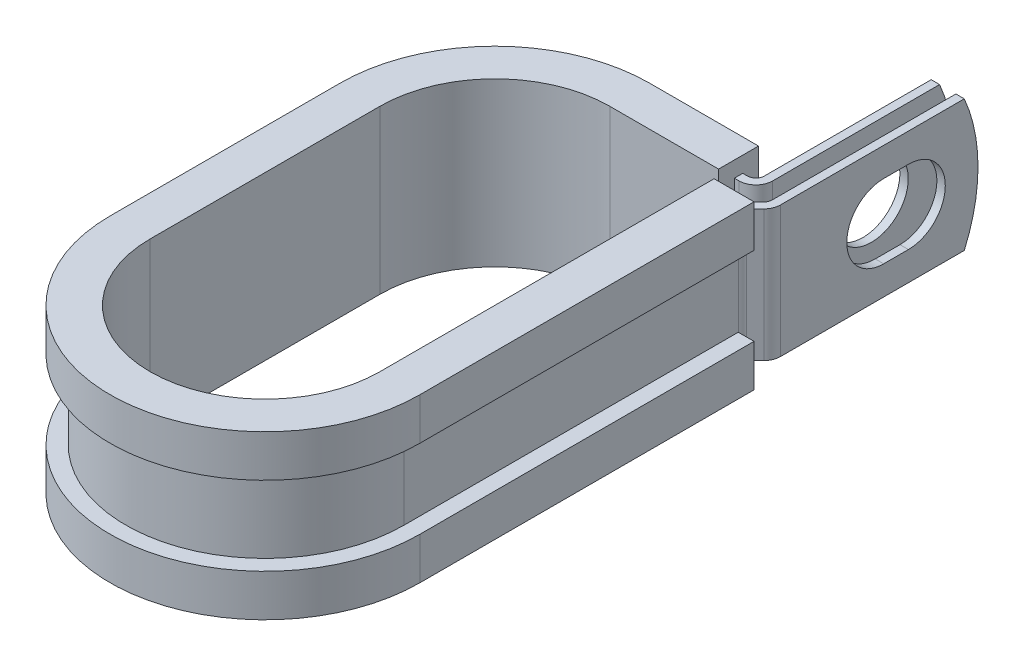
ISO-10303-21;
HEADER;
FILE_DESCRIPTION(('STEP AP214'),'2;1');
FILE_NAME('part.step','',(''),(''),'','','');
FILE_SCHEMA(('AUTOMOTIVE_DESIGN { 1 0 10303 214 1 1 1 1 }'));
ENDSEC;
DATA;
#1=APPLICATION_CONTEXT('core data for automotive mechanical design processes');
#2=APPLICATION_PROTOCOL_DEFINITION('international standard','automotive_design',2000,#1);
#3=PRODUCT_CONTEXT('',#1,'mechanical');
#4=PRODUCT('Part','Part','',(#3));
#5=PRODUCT_RELATED_PRODUCT_CATEGORY('part','',(#4));
#6=PRODUCT_DEFINITION_FORMATION('','',#4);
#7=PRODUCT_DEFINITION_CONTEXT('part definition',#1,'design');
#8=PRODUCT_DEFINITION('design','',#6,#7);
#9=PRODUCT_DEFINITION_SHAPE('','',#8);
#10=(LENGTH_UNIT() NAMED_UNIT(*) SI_UNIT(.MILLI.,.METRE.));
#11=(NAMED_UNIT(*) PLANE_ANGLE_UNIT() SI_UNIT($,.RADIAN.));
#12=(NAMED_UNIT(*) SI_UNIT($,.STERADIAN.) SOLID_ANGLE_UNIT());
#13=UNCERTAINTY_MEASURE_WITH_UNIT(LENGTH_MEASURE(1.E-05),#10,'distance_accuracy_value','');
#14=(GEOMETRIC_REPRESENTATION_CONTEXT(3) GLOBAL_UNCERTAINTY_ASSIGNED_CONTEXT((#13)) GLOBAL_UNIT_ASSIGNED_CONTEXT((#10,
#11,#12)) REPRESENTATION_CONTEXT('',''));
#15=CARTESIAN_POINT('',(0.,0.,0.));
#16=DIRECTION('',(0.,0.,1.));
#17=DIRECTION('',(1.,0.,0.));
#18=AXIS2_PLACEMENT_3D('',#15,#16,#17);
#19=CARTESIAN_POINT('',(13.3640743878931,-6.35,-12.6365));
#20=DIRECTION('',(0.,1.,0.));
#21=DIRECTION('',(1.,0.,0.));
#22=AXIS2_PLACEMENT_3D('',#19,#20,#21);
#23=PLANE('',#22);
#24=DIRECTION('',(0.,0.,-1.));
#25=VECTOR('',#24,1.);
#26=CARTESIAN_POINT('',(10.5192743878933,-6.35,-12.6365));
#27=LINE('',#26,#25);
#28=CARTESIAN_POINT('',(10.5192743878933,-6.35,-12.6365));
#29=VERTEX_POINT('',#28);
#30=CARTESIAN_POINT('',(10.5192743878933,-6.35,-13.4493));
#31=VERTEX_POINT('',#30);
#32=EDGE_CURVE('E582',#29,#31,#27,.T.);
#33=ORIENTED_EDGE('',*,*,#32,.T.);
#34=DIRECTION('',(1.,0.,0.));
#35=VECTOR('',#34,1.);
#36=CARTESIAN_POINT('',(0.,-6.35,-13.4493));
#37=LINE('',#36,#35);
#38=CARTESIAN_POINT('',(10.9764743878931,-6.35,-13.4493));
#39=VERTEX_POINT('',#38);
#40=EDGE_CURVE('E416',#39,#31,#37,.F.);
#41=ORIENTED_EDGE('',*,*,#40,.F.);
#42=CARTESIAN_POINT('',(10.9764743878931,-6.35,-14.2621));
#43=DIRECTION('',(0.,1.,0.));
#44=DIRECTION('',(1.,0.,0.));
#45=AXIS2_PLACEMENT_3D('',#42,#43,#44);
#46=CIRCLE('',#45,0.8128);
#47=CARTESIAN_POINT('',(11.7892743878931,-6.35,-14.2621));
#48=VERTEX_POINT('',#47);
#49=EDGE_CURVE('E414',#48,#39,#46,.F.);
#50=ORIENTED_EDGE('',*,*,#49,.F.);
#51=DIRECTION('',(0.,0.,1.));
#52=VECTOR('',#51,1.);
#53=CARTESIAN_POINT('',(11.7892743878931,-6.35,-31.7246));
#54=LINE('',#53,#52);
#55=CARTESIAN_POINT('',(11.7892743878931,-6.35,-30.3992778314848));
#56=VERTEX_POINT('',#55);
#57=EDGE_CURVE('E412',#56,#48,#54,.T.);
#58=ORIENTED_EDGE('',*,*,#57,.F.);
#59=DIRECTION('',(-1.,0.,0.));
#60=VECTOR('',#59,1.);
#61=CARTESIAN_POINT('',(14.9896743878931,-6.35,-30.3992778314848));
#62=LINE('',#61,#60);
#63=CARTESIAN_POINT('',(12.6020743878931,-6.35,-30.3992778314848));
#64=VERTEX_POINT('',#63);
#65=EDGE_CURVE('E12',#64,#56,#62,.T.);
#66=ORIENTED_EDGE('',*,*,#65,.F.);
#67=DIRECTION('',(0.,0.,1.));
#68=VECTOR('',#67,1.);
#69=CARTESIAN_POINT('',(12.6020743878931,-6.35,-31.7246));
#70=LINE('',#69,#68);
#71=CARTESIAN_POINT('',(12.6020743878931,-6.35,-14.2621));
#72=VERTEX_POINT('',#71);
#73=EDGE_CURVE('E410',#64,#72,#70,.T.);
#74=ORIENTED_EDGE('',*,*,#73,.T.);
#75=CARTESIAN_POINT('',(10.9764743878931,-6.35,-14.2621));
#76=DIRECTION('',(0.,-1.,0.));
#77=DIRECTION('',(0.,0.,1.));
#78=AXIS2_PLACEMENT_3D('',#75,#76,#77);
#79=CIRCLE('',#78,1.6256);
#80=CARTESIAN_POINT('',(10.9764743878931,-6.35,-12.6365));
#81=VERTEX_POINT('',#80);
#82=EDGE_CURVE('E407',#72,#81,#79,.T.);
#83=ORIENTED_EDGE('',*,*,#82,.T.);
#84=DIRECTION('',(-1.,0.,0.));
#85=VECTOR('',#84,1.);
#86=CARTESIAN_POINT('',(0.,-6.35,-12.6365));
#87=LINE('',#86,#85);
#88=EDGE_CURVE('E404',#81,#29,#87,.T.);
#89=ORIENTED_EDGE('',*,*,#88,.T.);
#90=EDGE_LOOP('',(#33,#41,#50,#58,#66,#74,#83,#89));
#91=FACE_BOUND('',#90,.T.);
#92=ADVANCED_FACE('F55',(#91),#23,.F.);
#93=CARTESIAN_POINT('',(13.3640743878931,6.35,-12.6365));
#94=DIRECTION('',(0.,1.,0.));
#95=DIRECTION('',(1.,0.,0.));
#96=AXIS2_PLACEMENT_3D('',#93,#94,#95);
#97=PLANE('',#96);
#98=DIRECTION('',(1.,0.,0.));
#99=VECTOR('',#98,1.);
#100=CARTESIAN_POINT('',(0.,6.35,-13.4493));
#101=LINE('',#100,#99);
#102=CARTESIAN_POINT('',(10.9764743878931,6.35,-13.4493));
#103=VERTEX_POINT('',#102);
#104=CARTESIAN_POINT('',(10.5192743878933,6.35,-13.4493));
#105=VERTEX_POINT('',#104);
#106=EDGE_CURVE('E377',#103,#105,#101,.F.);
#107=ORIENTED_EDGE('',*,*,#106,.T.);
#108=DIRECTION('',(0.,0.,1.));
#109=VECTOR('',#108,1.);
#110=CARTESIAN_POINT('',(10.5192743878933,6.35,-13.4493));
#111=LINE('',#110,#109);
#112=CARTESIAN_POINT('',(10.5192743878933,6.35,-12.6365));
#113=VERTEX_POINT('',#112);
#114=EDGE_CURVE('E588',#105,#113,#111,.T.);
#115=ORIENTED_EDGE('',*,*,#114,.T.);
#116=DIRECTION('',(-1.,0.,0.));
#117=VECTOR('',#116,1.);
#118=CARTESIAN_POINT('',(0.,6.35,-12.6365));
#119=LINE('',#118,#117);
#120=CARTESIAN_POINT('',(10.9764743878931,6.35,-12.6365));
#121=VERTEX_POINT('',#120);
#122=EDGE_CURVE('E479',#121,#113,#119,.T.);
#123=ORIENTED_EDGE('',*,*,#122,.F.);
#124=CARTESIAN_POINT('',(10.9764743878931,6.35,-14.2621));
#125=DIRECTION('',(0.,-1.,0.));
#126=DIRECTION('',(0.,0.,1.));
#127=AXIS2_PLACEMENT_3D('',#124,#125,#126);
#128=CIRCLE('',#127,1.6256);
#129=CARTESIAN_POINT('',(12.6020743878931,6.35,-14.2621));
#130=VERTEX_POINT('',#129);
#131=EDGE_CURVE('E474',#130,#121,#128,.T.);
#132=ORIENTED_EDGE('',*,*,#131,.F.);
#133=DIRECTION('',(0.,0.,1.));
#134=VECTOR('',#133,1.);
#135=CARTESIAN_POINT('',(12.6020743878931,6.35,-31.7246));
#136=LINE('',#135,#134);
#137=CARTESIAN_POINT('',(12.6020743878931,6.35,-30.3992778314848));
#138=VERTEX_POINT('',#137);
#139=EDGE_CURVE('E468',#138,#130,#136,.T.);
#140=ORIENTED_EDGE('',*,*,#139,.F.);
#141=DIRECTION('',(-1.,0.,0.));
#142=VECTOR('',#141,1.);
#143=CARTESIAN_POINT('',(14.9896743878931,6.35,-30.3992778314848));
#144=LINE('',#143,#142);
#145=CARTESIAN_POINT('',(11.7892743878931,6.35,-30.3992778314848));
#146=VERTEX_POINT('',#145);
#147=EDGE_CURVE('E63',#138,#146,#144,.T.);
#148=ORIENTED_EDGE('',*,*,#147,.T.);
#149=DIRECTION('',(0.,0.,1.));
#150=VECTOR('',#149,1.);
#151=CARTESIAN_POINT('',(11.7892743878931,6.35,-31.7246));
#152=LINE('',#151,#150);
#153=CARTESIAN_POINT('',(11.7892743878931,6.35,-14.2621));
#154=VERTEX_POINT('',#153);
#155=EDGE_CURVE('E465',#146,#154,#152,.T.);
#156=ORIENTED_EDGE('',*,*,#155,.T.);
#157=CARTESIAN_POINT('',(10.9764743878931,6.35,-14.2621));
#158=DIRECTION('',(0.,1.,0.));
#159=DIRECTION('',(1.,0.,0.));
#160=AXIS2_PLACEMENT_3D('',#157,#158,#159);
#161=CIRCLE('',#160,0.8128);
#162=EDGE_CURVE('E382',#154,#103,#161,.F.);
#163=ORIENTED_EDGE('',*,*,#162,.T.);
#164=EDGE_LOOP('',(#107,#115,#123,#132,#140,#148,#156,#163));
#165=FACE_BOUND('',#164,.T.);
#166=ADVANCED_FACE('F464',(#165),#97,.T.);
#167=CARTESIAN_POINT('',(0.,6.35,-12.6365));
#168=DIRECTION('',(0.,0.,1.));
#169=DIRECTION('',(1.,0.,0.));
#170=AXIS2_PLACEMENT_3D('',#167,#168,#169);
#171=PLANE('',#170);
#172=ORIENTED_EDGE('',*,*,#122,.T.);
#173=DIRECTION('',(0.,-1.,0.));
#174=VECTOR('',#173,1.);
#175=CARTESIAN_POINT('',(10.5192743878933,6.35,-12.6365));
#176=LINE('',#175,#174);
#177=EDGE_CURVE('E585',#113,#29,#176,.T.);
#178=ORIENTED_EDGE('',*,*,#177,.T.);
#179=ORIENTED_EDGE('',*,*,#88,.F.);
#180=DIRECTION('',(0.,-1.,0.));
#181=VECTOR('',#180,1.);
#182=CARTESIAN_POINT('',(10.9764743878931,6.35,-12.6365));
#183=LINE('',#182,#181);
#184=EDGE_CURVE('E452',#121,#81,#183,.T.);
#185=ORIENTED_EDGE('',*,*,#184,.F.);
#186=EDGE_LOOP('',(#172,#178,#179,#185));
#187=FACE_BOUND('',#186,.T.);
#188=ADVANCED_FACE('F789',(#187),#171,.T.);
#189=CARTESIAN_POINT('',(14.9896743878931,6.35,-12.6365));
#190=DIRECTION('',(-1.,0.,0.));
#191=DIRECTION('',(0.,0.,1.));
#192=AXIS2_PLACEMENT_3D('',#189,#190,#191);
#193=PLANE('',#192);
#194=CARTESIAN_POINT('',(14.9896743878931,0.,-24.9936));
#195=DIRECTION('',(1.,0.,0.));
#196=DIRECTION('',(0.,0.,-1.));
#197=AXIS2_PLACEMENT_3D('',#194,#195,#196);
#198=CIRCLE('',#197,3.5687);
#199=CARTESIAN_POINT('',(14.9896743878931,-3.5687,-24.9936));
#200=VERTEX_POINT('',#199);
#201=CARTESIAN_POINT('',(14.9896743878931,3.5687,-24.9936));
#202=VERTEX_POINT('',#201);
#203=EDGE_CURVE('E527',#200,#202,#198,.T.);
#204=ORIENTED_EDGE('',*,*,#203,.F.);
#205=DIRECTION('',(0.,0.,-1.));
#206=VECTOR('',#205,1.);
#207=CARTESIAN_POINT('',(14.9896743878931,-3.5687,-22.606));
#208=LINE('',#207,#206);
#209=CARTESIAN_POINT('',(14.9896743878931,-3.5687,-22.606));
#210=VERTEX_POINT('',#209);
#211=EDGE_CURVE('E524',#210,#200,#208,.T.);
#212=ORIENTED_EDGE('',*,*,#211,.F.);
#213=CARTESIAN_POINT('',(14.9896743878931,0.,-22.606));
#214=DIRECTION('',(1.,0.,0.));
#215=DIRECTION('',(0.,0.,-1.));
#216=AXIS2_PLACEMENT_3D('',#213,#214,#215);
#217=CIRCLE('',#216,3.5687);
#218=CARTESIAN_POINT('',(14.9896743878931,3.5687,-22.606));
#219=VERTEX_POINT('',#218);
#220=EDGE_CURVE('E521',#219,#210,#217,.T.);
#221=ORIENTED_EDGE('',*,*,#220,.F.);
#222=DIRECTION('',(0.,0.,1.));
#223=VECTOR('',#222,1.);
#224=CARTESIAN_POINT('',(14.9896743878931,3.5687,-22.606));
#225=LINE('',#224,#223);
#226=EDGE_CURVE('E520',#202,#219,#225,.T.);
#227=ORIENTED_EDGE('',*,*,#226,.F.);
#228=EDGE_LOOP('',(#204,#212,#221,#227));
#229=FACE_BOUND('',#228,.T.);
#230=DIRECTION('',(0.,0.,-1.));
#231=VECTOR('',#230,1.);
#232=CARTESIAN_POINT('',(14.9896743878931,-6.35,-12.6365));
#233=LINE('',#232,#231);
#234=CARTESIAN_POINT('',(14.9896743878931,-6.35,-12.6365));
#235=VERTEX_POINT('',#234);
#236=CARTESIAN_POINT('',(14.9896743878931,-6.35,-30.3992778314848));
#237=VERTEX_POINT('',#236);
#238=EDGE_CURVE('E388',#235,#237,#233,.T.);
#239=ORIENTED_EDGE('',*,*,#238,.T.);
#240=CARTESIAN_POINT('',(14.9896743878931,0.,-15.8496));
#241=DIRECTION('',(-1.,0.,0.));
#242=DIRECTION('',(0.,0.,1.));
#243=AXIS2_PLACEMENT_3D('',#240,#241,#242);
#244=CIRCLE('',#243,15.875);
#245=CARTESIAN_POINT('',(14.9896743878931,6.35,-30.3992778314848));
#246=VERTEX_POINT('',#245);
#247=EDGE_CURVE('E536',#246,#237,#244,.T.);
#248=ORIENTED_EDGE('',*,*,#247,.F.);
#249=DIRECTION('',(0.,0.,-1.));
#250=VECTOR('',#249,1.);
#251=CARTESIAN_POINT('',(14.9896743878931,6.35,-12.6365));
#252=LINE('',#251,#250);
#253=CARTESIAN_POINT('',(14.9896743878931,6.35,-12.6365));
#254=VERTEX_POINT('',#253);
#255=EDGE_CURVE('E425',#254,#246,#252,.T.);
#256=ORIENTED_EDGE('',*,*,#255,.F.);
#257=DIRECTION('',(0.,-1.,0.));
#258=VECTOR('',#257,1.);
#259=CARTESIAN_POINT('',(14.9896743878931,6.35,-12.6365));
#260=LINE('',#259,#258);
#261=EDGE_CURVE('E387',#254,#235,#260,.T.);
#262=ORIENTED_EDGE('',*,*,#261,.T.);
#263=EDGE_LOOP('',(#239,#248,#256,#262));
#264=FACE_BOUND('',#263,.T.);
#265=ADVANCED_FACE('F57',(#229,#264),#193,.F.);
#266=CARTESIAN_POINT('',(14.1768743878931,6.35,-12.6365));
#267=DIRECTION('',(-1.,0.,0.));
#268=DIRECTION('',(0.,0.,1.));
#269=AXIS2_PLACEMENT_3D('',#266,#267,#268);
#270=PLANE('',#269);
#271=DIRECTION('',(0.,0.,-1.));
#272=VECTOR('',#271,1.);
#273=CARTESIAN_POINT('',(14.1768743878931,-3.5687,-22.606));
#274=LINE('',#273,#272);
#275=CARTESIAN_POINT('',(14.1768743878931,-3.5687,-22.606));
#276=VERTEX_POINT('',#275);
#277=CARTESIAN_POINT('',(14.1768743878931,-3.5687,-24.9936));
#278=VERTEX_POINT('',#277);
#279=EDGE_CURVE('E505',#276,#278,#274,.T.);
#280=ORIENTED_EDGE('',*,*,#279,.T.);
#281=CARTESIAN_POINT('',(14.1768743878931,0.,-24.9936));
#282=DIRECTION('',(-1.,0.,0.));
#283=DIRECTION('',(0.,0.,1.));
#284=AXIS2_PLACEMENT_3D('',#281,#282,#283);
#285=CIRCLE('',#284,3.5687);
#286=CARTESIAN_POINT('',(14.1768743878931,3.5687,-24.9936));
#287=VERTEX_POINT('',#286);
#288=EDGE_CURVE('E504',#278,#287,#285,.F.);
#289=ORIENTED_EDGE('',*,*,#288,.T.);
#290=DIRECTION('',(0.,0.,1.));
#291=VECTOR('',#290,1.);
#292=CARTESIAN_POINT('',(14.1768743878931,3.5687,-22.606));
#293=LINE('',#292,#291);
#294=CARTESIAN_POINT('',(14.1768743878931,3.5687,-22.606));
#295=VERTEX_POINT('',#294);
#296=EDGE_CURVE('E508',#287,#295,#293,.T.);
#297=ORIENTED_EDGE('',*,*,#296,.T.);
#298=CARTESIAN_POINT('',(14.1768743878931,0.,-22.606));
#299=DIRECTION('',(-1.,0.,0.));
#300=DIRECTION('',(0.,0.,1.));
#301=AXIS2_PLACEMENT_3D('',#298,#299,#300);
#302=CIRCLE('',#301,3.5687);
#303=EDGE_CURVE('E501',#295,#276,#302,.F.);
#304=ORIENTED_EDGE('',*,*,#303,.T.);
#305=EDGE_LOOP('',(#280,#289,#297,#304));
#306=FACE_BOUND('',#305,.T.);
#307=CARTESIAN_POINT('',(14.1768743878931,0.,-15.8496));
#308=DIRECTION('',(-1.,0.,0.));
#309=DIRECTION('',(0.,0.,1.));
#310=AXIS2_PLACEMENT_3D('',#307,#308,#309);
#311=CIRCLE('',#310,15.875);
#312=CARTESIAN_POINT('',(14.1768743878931,6.35,-30.3992778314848));
#313=VERTEX_POINT('',#312);
#314=CARTESIAN_POINT('',(14.1768743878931,-6.35,-30.3992778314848));
#315=VERTEX_POINT('',#314);
#316=EDGE_CURVE('E77',#313,#315,#311,.T.);
#317=ORIENTED_EDGE('',*,*,#316,.T.);
#318=DIRECTION('',(0.,0.,-1.));
#319=VECTOR('',#318,1.);
#320=CARTESIAN_POINT('',(14.1768743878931,-6.35,-12.6365));
#321=LINE('',#320,#319);
#322=CARTESIAN_POINT('',(14.1768743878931,-6.35,-12.6365));
#323=VERTEX_POINT('',#322);
#324=EDGE_CURVE('E391',#323,#315,#321,.T.);
#325=ORIENTED_EDGE('',*,*,#324,.F.);
#326=DIRECTION('',(0.,-1.,0.));
#327=VECTOR('',#326,1.);
#328=CARTESIAN_POINT('',(14.1768743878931,6.35,-12.6365));
#329=LINE('',#328,#327);
#330=CARTESIAN_POINT('',(14.1768743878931,6.35,-12.6365));
#331=VERTEX_POINT('',#330);
#332=EDGE_CURVE('E460',#331,#323,#329,.T.);
#333=ORIENTED_EDGE('',*,*,#332,.F.);
#334=DIRECTION('',(0.,0.,-1.));
#335=VECTOR('',#334,1.);
#336=CARTESIAN_POINT('',(14.1768743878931,6.35,-12.6365));
#337=LINE('',#336,#335);
#338=EDGE_CURVE('E489',#331,#313,#337,.T.);
#339=ORIENTED_EDGE('',*,*,#338,.T.);
#340=EDGE_LOOP('',(#317,#325,#333,#339));
#341=FACE_BOUND('',#340,.T.);
#342=ADVANCED_FACE('F762',(#306,#341),#270,.T.);
#343=CARTESIAN_POINT('',(12.6020743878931,6.35,-31.7246));
#344=DIRECTION('',(1.,0.,0.));
#345=DIRECTION('',(0.,0.,-1.));
#346=AXIS2_PLACEMENT_3D('',#343,#344,#345);
#347=PLANE('',#346);
#348=CARTESIAN_POINT('',(12.6020743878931,0.,-23.7998));
#349=DIRECTION('',(1.,0.,0.));
#350=DIRECTION('',(0.,0.,-1.));
#351=AXIS2_PLACEMENT_3D('',#348,#349,#350);
#352=CIRCLE('',#351,3.5687);
#353=CARTESIAN_POINT('',(12.6020743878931,0.,-27.3685));
#354=VERTEX_POINT('',#353);
#355=EDGE_CURVE('E392',#354,#354,#352,.F.);
#356=ORIENTED_EDGE('',*,*,#355,.T.);
#357=EDGE_LOOP('',(#356));
#358=FACE_BOUND('',#357,.T.);
#359=ORIENTED_EDGE('',*,*,#73,.F.);
#360=CARTESIAN_POINT('',(12.6020743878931,0.,-15.8496));
#361=DIRECTION('',(1.,0.,0.));
#362=DIRECTION('',(0.,0.,-1.));
#363=AXIS2_PLACEMENT_3D('',#360,#361,#362);
#364=CIRCLE('',#363,15.875);
#365=EDGE_CURVE('E532',#64,#138,#364,.T.);
#366=ORIENTED_EDGE('',*,*,#365,.T.);
#367=ORIENTED_EDGE('',*,*,#139,.T.);
#368=DIRECTION('',(0.,-1.,0.));
#369=VECTOR('',#368,1.);
#370=CARTESIAN_POINT('',(12.6020743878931,6.35,-14.2621));
#371=LINE('',#370,#369);
#372=EDGE_CURVE('E449',#130,#72,#371,.T.);
#373=ORIENTED_EDGE('',*,*,#372,.T.);
#374=EDGE_LOOP('',(#359,#366,#367,#373));
#375=FACE_BOUND('',#374,.T.);
#376=ADVANCED_FACE('F797',(#358,#375),#347,.T.);
#377=CARTESIAN_POINT('',(11.7892743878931,6.35,-31.7246));
#378=DIRECTION('',(1.,0.,0.));
#379=DIRECTION('',(0.,0.,-1.));
#380=AXIS2_PLACEMENT_3D('',#377,#378,#379);
#381=PLANE('',#380);
#382=CARTESIAN_POINT('',(11.7892743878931,0.,-23.7998));
#383=DIRECTION('',(-1.,0.,0.));
#384=DIRECTION('',(0.,0.,1.));
#385=AXIS2_PLACEMENT_3D('',#382,#383,#384);
#386=CIRCLE('',#385,3.5687);
#387=CARTESIAN_POINT('',(11.7892743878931,0.,-20.2311));
#388=VERTEX_POINT('',#387);
#389=EDGE_CURVE('E496',#388,#388,#386,.T.);
#390=ORIENTED_EDGE('',*,*,#389,.F.);
#391=EDGE_LOOP('',(#390));
#392=FACE_BOUND('',#391,.T.);
#393=CARTESIAN_POINT('',(11.7892743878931,0.,-15.8496));
#394=DIRECTION('',(-1.,0.,0.));
#395=DIRECTION('',(0.,0.,1.));
#396=AXIS2_PLACEMENT_3D('',#393,#394,#395);
#397=CIRCLE('',#396,15.875);
#398=EDGE_CURVE('E69',#146,#56,#397,.T.);
#399=ORIENTED_EDGE('',*,*,#398,.T.);
#400=ORIENTED_EDGE('',*,*,#57,.T.);
#401=DIRECTION('',(0.,-1.,0.));
#402=VECTOR('',#401,1.);
#403=CARTESIAN_POINT('',(11.7892743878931,6.35,-14.2621));
#404=LINE('',#403,#402);
#405=EDGE_CURVE('E446',#154,#48,#404,.T.);
#406=ORIENTED_EDGE('',*,*,#405,.F.);
#407=ORIENTED_EDGE('',*,*,#155,.F.);
#408=EDGE_LOOP('',(#399,#400,#406,#407));
#409=FACE_BOUND('',#408,.T.);
#410=ADVANCED_FACE('F471',(#392,#409),#381,.F.);
#411=CARTESIAN_POINT('',(14.2621,-6.35,-10.0861072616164));
#412=DIRECTION('',(0.,1.,0.));
#413=DIRECTION('',(1.,0.,0.));
#414=AXIS2_PLACEMENT_3D('',#411,#412,#413);
#415=CIRCLE('',#414,0.8128);
#416=CARTESIAN_POINT('',(13.4493,-6.35,-10.0861072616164));
#417=VERTEX_POINT('',#416);
#418=CARTESIAN_POINT('',(13.6873636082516,-6.35,-10.6608436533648));
#419=VERTEX_POINT('',#418);
#420=EDGE_CURVE('E419',#417,#419,#415,.F.);
#421=ORIENTED_EDGE('',*,*,#420,.F.);
#422=DIRECTION('',(1.,0.,0.));
#423=VECTOR('',#422,1.);
#424=CARTESIAN_POINT('',(12.6365,-6.35,-10.0861072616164));
#425=LINE('',#424,#423);
#426=CARTESIAN_POINT('',(12.6365,-6.35,-10.0861072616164));
#427=VERTEX_POINT('',#426);
#428=EDGE_CURVE('E370',#427,#417,#425,.T.);
#429=ORIENTED_EDGE('',*,*,#428,.F.);
#430=CARTESIAN_POINT('',(14.2621,-6.35,-10.0861072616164));
#431=DIRECTION('',(0.,-1.,0.));
#432=DIRECTION('',(0.,0.,1.));
#433=AXIS2_PLACEMENT_3D('',#430,#431,#432);
#434=CIRCLE('',#433,1.6256);
#435=CARTESIAN_POINT('',(13.1126272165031,-6.35,-11.2355800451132));
#436=VERTEX_POINT('',#435);
#437=EDGE_CURVE('E401',#427,#436,#434,.T.);
#438=ORIENTED_EDGE('',*,*,#437,.T.);
#439=DIRECTION('',(0.707106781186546,0.,-0.707106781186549));
#440=VECTOR('',#439,1.);
#441=CARTESIAN_POINT('',(13.1126272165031,-6.35,-11.2355800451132));
#442=LINE('',#441,#440);
#443=CARTESIAN_POINT('',(13.9388107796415,-6.35,-12.0617636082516));
#444=VERTEX_POINT('',#443);
#445=EDGE_CURVE('E398',#436,#444,#442,.T.);
#446=ORIENTED_EDGE('',*,*,#445,.T.);
#447=CARTESIAN_POINT('',(13.3640743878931,-6.35,-12.6365));
#448=DIRECTION('',(0.,1.,0.));
#449=DIRECTION('',(0.,0.,1.));
#450=AXIS2_PLACEMENT_3D('',#447,#448,#449);
#451=CIRCLE('',#450,0.8128);
#452=EDGE_CURVE('E395',#444,#323,#451,.T.);
#453=ORIENTED_EDGE('',*,*,#452,.T.);
#454=ORIENTED_EDGE('',*,*,#324,.T.);
#455=DIRECTION('',(-1.,0.,0.));
#456=VECTOR('',#455,1.);
#457=CARTESIAN_POINT('',(14.9896743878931,-6.35,-30.3992778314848));
#458=LINE('',#457,#456);
#459=EDGE_CURVE('E538',#237,#315,#458,.T.);
#460=ORIENTED_EDGE('',*,*,#459,.F.);
#461=ORIENTED_EDGE('',*,*,#238,.F.);
#462=CARTESIAN_POINT('',(13.3640743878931,-6.35,-12.6365));
#463=DIRECTION('',(0.,1.,0.));
#464=DIRECTION('',(1.,0.,0.));
#465=AXIS2_PLACEMENT_3D('',#462,#463,#464);
#466=CIRCLE('',#465,1.6256);
#467=CARTESIAN_POINT('',(14.5135471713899,-6.35,-11.4870272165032));
#468=VERTEX_POINT('',#467);
#469=EDGE_CURVE('E423',#468,#235,#466,.T.);
#470=ORIENTED_EDGE('',*,*,#469,.F.);
#471=DIRECTION('',(0.707106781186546,0.,-0.707106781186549));
#472=VECTOR('',#471,1.);
#473=CARTESIAN_POINT('',(13.6873636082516,-6.35,-10.6608436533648));
#474=LINE('',#473,#472);
#475=EDGE_CURVE('E421',#419,#468,#474,.T.);
#476=ORIENTED_EDGE('',*,*,#475,.F.);
#477=EDGE_LOOP('',(#421,#429,#438,#446,#453,#454,#460,#461,#470,#476));
#478=FACE_BOUND('',#477,.T.);
#479=ADVANCED_FACE('F743',(#478),#23,.F.);
#480=DIRECTION('',(-1.,0.,0.));
#481=VECTOR('',#480,1.);
#482=CARTESIAN_POINT('',(13.4493,6.35,-10.0861072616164));
#483=LINE('',#482,#481);
#484=CARTESIAN_POINT('',(13.4493,6.35,-10.0861072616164));
#485=VERTEX_POINT('',#484);
#486=CARTESIAN_POINT('',(12.6365,6.35,-10.0861072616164));
#487=VERTEX_POINT('',#486);
#488=EDGE_CURVE('E350',#485,#487,#483,.T.);
#489=ORIENTED_EDGE('',*,*,#488,.F.);
#490=CARTESIAN_POINT('',(14.2621,6.35,-10.0861072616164));
#491=DIRECTION('',(0.,1.,0.));
#492=DIRECTION('',(1.,0.,0.));
#493=AXIS2_PLACEMENT_3D('',#490,#491,#492);
#494=CIRCLE('',#493,0.8128);
#495=CARTESIAN_POINT('',(13.6873636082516,6.35,-10.6608436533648));
#496=VERTEX_POINT('',#495);
#497=EDGE_CURVE('E365',#485,#496,#494,.F.);
#498=ORIENTED_EDGE('',*,*,#497,.T.);
#499=DIRECTION('',(0.707106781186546,0.,-0.707106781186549));
#500=VECTOR('',#499,1.);
#501=CARTESIAN_POINT('',(13.6873636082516,6.35,-10.6608436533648));
#502=LINE('',#501,#500);
#503=CARTESIAN_POINT('',(14.5135471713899,6.35,-11.4870272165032));
#504=VERTEX_POINT('',#503);
#505=EDGE_CURVE('E376',#496,#504,#502,.T.);
#506=ORIENTED_EDGE('',*,*,#505,.T.);
#507=CARTESIAN_POINT('',(13.3640743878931,6.35,-12.6365));
#508=DIRECTION('',(0.,1.,0.));
#509=DIRECTION('',(1.,0.,0.));
#510=AXIS2_PLACEMENT_3D('',#507,#508,#509);
#511=CIRCLE('',#510,1.6256);
#512=EDGE_CURVE('E379',#504,#254,#511,.T.);
#513=ORIENTED_EDGE('',*,*,#512,.T.);
#514=ORIENTED_EDGE('',*,*,#255,.T.);
#515=DIRECTION('',(-1.,0.,0.));
#516=VECTOR('',#515,1.);
#517=CARTESIAN_POINT('',(14.9896743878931,6.35,-30.3992778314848));
#518=LINE('',#517,#516);
#519=EDGE_CURVE('E534',#246,#313,#518,.T.);
#520=ORIENTED_EDGE('',*,*,#519,.T.);
#521=ORIENTED_EDGE('',*,*,#338,.F.);
#522=CARTESIAN_POINT('',(13.3640743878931,6.35,-12.6365));
#523=DIRECTION('',(0.,1.,0.));
#524=DIRECTION('',(0.,0.,1.));
#525=AXIS2_PLACEMENT_3D('',#522,#523,#524);
#526=CIRCLE('',#525,0.8128);
#527=CARTESIAN_POINT('',(13.9388107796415,6.35,-12.0617636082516));
#528=VERTEX_POINT('',#527);
#529=EDGE_CURVE('E486',#528,#331,#526,.T.);
#530=ORIENTED_EDGE('',*,*,#529,.F.);
#531=DIRECTION('',(0.707106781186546,0.,-0.707106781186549));
#532=VECTOR('',#531,1.);
#533=CARTESIAN_POINT('',(13.1126272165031,6.35,-11.2355800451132));
#534=LINE('',#533,#532);
#535=CARTESIAN_POINT('',(13.1126272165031,6.35,-11.2355800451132));
#536=VERTEX_POINT('',#535);
#537=EDGE_CURVE('E483',#536,#528,#534,.T.);
#538=ORIENTED_EDGE('',*,*,#537,.F.);
#539=CARTESIAN_POINT('',(14.2621,6.35,-10.0861072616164));
#540=DIRECTION('',(0.,-1.,0.));
#541=DIRECTION('',(0.,0.,1.));
#542=AXIS2_PLACEMENT_3D('',#539,#540,#541);
#543=CIRCLE('',#542,1.6256);
#544=EDGE_CURVE('E369',#487,#536,#543,.T.);
#545=ORIENTED_EDGE('',*,*,#544,.F.);
#546=EDGE_LOOP('',(#489,#498,#506,#513,#514,#520,#521,#530,#538,#545));
#547=FACE_BOUND('',#546,.T.);
#548=ADVANCED_FACE('F364',(#547),#97,.T.);
#549=CARTESIAN_POINT('',(13.3640743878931,6.35,-12.6365));
#550=DIRECTION('',(0.,-1.,0.));
#551=DIRECTION('',(0.,0.,-1.));
#552=AXIS2_PLACEMENT_3D('',#549,#550,#551);
#553=CYLINDRICAL_SURFACE('',#552,0.8128);
#554=ORIENTED_EDGE('',*,*,#452,.F.);
#555=DIRECTION('',(0.,-1.,0.));
#556=VECTOR('',#555,1.);
#557=CARTESIAN_POINT('',(13.9388107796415,6.35,-12.0617636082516));
#558=LINE('',#557,#556);
#559=EDGE_CURVE('E458',#528,#444,#558,.T.);
#560=ORIENTED_EDGE('',*,*,#559,.F.);
#561=ORIENTED_EDGE('',*,*,#529,.T.);
#562=ORIENTED_EDGE('',*,*,#332,.T.);
#563=EDGE_LOOP('',(#554,#560,#561,#562));
#564=FACE_BOUND('',#563,.T.);
#565=ADVANCED_FACE('F765',(#564),#553,.F.);
#566=CARTESIAN_POINT('',(13.1126272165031,6.35,-11.2355800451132));
#567=DIRECTION('',(-0.707106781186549,0.,-0.707106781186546));
#568=DIRECTION('',(-0.707106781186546,0.,0.707106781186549));
#569=AXIS2_PLACEMENT_3D('',#566,#567,#568);
#570=PLANE('',#569);
#571=ORIENTED_EDGE('',*,*,#445,.F.);
#572=DIRECTION('',(0.,-1.,0.));
#573=VECTOR('',#572,1.);
#574=CARTESIAN_POINT('',(13.1126272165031,6.35,-11.2355800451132));
#575=LINE('',#574,#573);
#576=EDGE_CURVE('E456',#536,#436,#575,.T.);
#577=ORIENTED_EDGE('',*,*,#576,.F.);
#578=ORIENTED_EDGE('',*,*,#537,.T.);
#579=ORIENTED_EDGE('',*,*,#559,.T.);
#580=EDGE_LOOP('',(#571,#577,#578,#579));
#581=FACE_BOUND('',#580,.T.);
#582=ADVANCED_FACE('F768',(#581),#570,.T.);
#583=CARTESIAN_POINT('',(14.2621,6.35,-10.0861072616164));
#584=DIRECTION('',(0.,-1.,0.));
#585=DIRECTION('',(0.,0.,-1.));
#586=AXIS2_PLACEMENT_3D('',#583,#584,#585);
#587=CYLINDRICAL_SURFACE('',#586,1.6256);
#588=ORIENTED_EDGE('',*,*,#437,.F.);
#589=DIRECTION('',(0.,-1.,0.));
#590=VECTOR('',#589,1.);
#591=CARTESIAN_POINT('',(12.6365,6.35,-10.0861072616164));
#592=LINE('',#591,#590);
#593=EDGE_CURVE('E454',#487,#427,#592,.T.);
#594=ORIENTED_EDGE('',*,*,#593,.F.);
#595=ORIENTED_EDGE('',*,*,#544,.T.);
#596=ORIENTED_EDGE('',*,*,#576,.T.);
#597=EDGE_LOOP('',(#588,#594,#595,#596));
#598=FACE_BOUND('',#597,.T.);
#599=ADVANCED_FACE('F770',(#598),#587,.T.);
#600=CARTESIAN_POINT('',(10.9764743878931,6.35,-14.2621));
#601=DIRECTION('',(0.,-1.,0.));
#602=DIRECTION('',(0.,0.,-1.));
#603=AXIS2_PLACEMENT_3D('',#600,#601,#602);
#604=CYLINDRICAL_SURFACE('',#603,1.6256);
#605=ORIENTED_EDGE('',*,*,#82,.F.);
#606=ORIENTED_EDGE('',*,*,#372,.F.);
#607=ORIENTED_EDGE('',*,*,#131,.T.);
#608=ORIENTED_EDGE('',*,*,#184,.T.);
#609=EDGE_LOOP('',(#605,#606,#607,#608));
#610=FACE_BOUND('',#609,.T.);
#611=ADVANCED_FACE('F772',(#610),#604,.T.);
#612=CARTESIAN_POINT('',(10.9764743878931,6.35,-14.2621));
#613=DIRECTION('',(0.,-1.,0.));
#614=DIRECTION('',(0.,0.,-1.));
#615=AXIS2_PLACEMENT_3D('',#612,#613,#614);
#616=CYLINDRICAL_SURFACE('',#615,0.8128);
#617=ORIENTED_EDGE('',*,*,#49,.T.);
#618=DIRECTION('',(0.,-1.,0.));
#619=VECTOR('',#618,1.);
#620=CARTESIAN_POINT('',(10.9764743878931,6.35,-13.4493));
#621=LINE('',#620,#619);
#622=EDGE_CURVE('E443',#103,#39,#621,.T.);
#623=ORIENTED_EDGE('',*,*,#622,.F.);
#624=ORIENTED_EDGE('',*,*,#162,.F.);
#625=ORIENTED_EDGE('',*,*,#405,.T.);
#626=EDGE_LOOP('',(#617,#623,#624,#625));
#627=FACE_BOUND('',#626,.T.);
#628=ADVANCED_FACE('F778',(#627),#616,.F.);
#629=CARTESIAN_POINT('',(0.,6.35,-13.4493));
#630=DIRECTION('',(0.,0.,1.));
#631=DIRECTION('',(1.,0.,0.));
#632=AXIS2_PLACEMENT_3D('',#629,#630,#631);
#633=PLANE('',#632);
#634=DIRECTION('',(0.,-1.,0.));
#635=VECTOR('',#634,1.);
#636=CARTESIAN_POINT('',(0.,6.35,-13.4493));
#637=LINE('',#636,#635);
#638=CARTESIAN_POINT('',(1.89512947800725E-13,3.81,-13.4493));
#639=VERTEX_POINT('',#638);
#640=CARTESIAN_POINT('',(1.89512947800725E-13,-3.81,-13.4493));
#641=VERTEX_POINT('',#640);
#642=EDGE_CURVE('E440',#639,#641,#637,.T.);
#643=ORIENTED_EDGE('',*,*,#642,.F.);
#644=DIRECTION('',(1.,0.,0.));
#645=VECTOR('',#644,1.);
#646=CARTESIAN_POINT('',(1.89512947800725E-13,3.81,-13.4493));
#647=LINE('',#646,#645);
#648=CARTESIAN_POINT('',(10.5192743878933,3.81,-13.4493));
#649=VERTEX_POINT('',#648);
#650=EDGE_CURVE('E541',#639,#649,#647,.T.);
#651=ORIENTED_EDGE('',*,*,#650,.T.);
#652=DIRECTION('',(0.,1.,0.));
#653=VECTOR('',#652,1.);
#654=CARTESIAN_POINT('',(10.5192743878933,6.35,-13.4493));
#655=LINE('',#654,#653);
#656=EDGE_CURVE('E591',#649,#105,#655,.T.);
#657=ORIENTED_EDGE('',*,*,#656,.T.);
#658=ORIENTED_EDGE('',*,*,#106,.F.);
#659=ORIENTED_EDGE('',*,*,#622,.T.);
#660=ORIENTED_EDGE('',*,*,#40,.T.);
#661=DIRECTION('',(0.,1.,0.));
#662=VECTOR('',#661,1.);
#663=CARTESIAN_POINT('',(10.5192743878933,-6.35,-13.4493));
#664=LINE('',#663,#662);
#665=CARTESIAN_POINT('',(10.5192743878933,-3.81,-13.4493));
#666=VERTEX_POINT('',#665);
#667=EDGE_CURVE('E579',#31,#666,#664,.T.);
#668=ORIENTED_EDGE('',*,*,#667,.T.);
#669=DIRECTION('',(1.,0.,0.));
#670=VECTOR('',#669,1.);
#671=CARTESIAN_POINT('',(1.89512947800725E-13,-3.81,-13.4493));
#672=LINE('',#671,#670);
#673=EDGE_CURVE('E562',#641,#666,#672,.T.);
#674=ORIENTED_EDGE('',*,*,#673,.F.);
#675=EDGE_LOOP('',(#643,#651,#657,#658,#659,#660,#668,#674));
#676=FACE_BOUND('',#675,.T.);
#677=ADVANCED_FACE('F830',(#676),#633,.F.);
#678=CARTESIAN_POINT('',(0.,6.35,0.));
#679=DIRECTION('',(0.,-1.,0.));
#680=DIRECTION('',(0.,0.,-1.));
#681=AXIS2_PLACEMENT_3D('',#678,#679,#680);
#682=CYLINDRICAL_SURFACE('',#681,13.4493);
#683=DIRECTION('',(0.,-1.,0.));
#684=VECTOR('',#683,1.);
#685=CARTESIAN_POINT('',(-13.4493,6.35,0.));
#686=LINE('',#685,#684);
#687=CARTESIAN_POINT('',(-13.4493,3.81,-1.87350135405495E-13));
#688=VERTEX_POINT('',#687);
#689=CARTESIAN_POINT('',(-13.4493,-3.81,-1.87350135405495E-13));
#690=VERTEX_POINT('',#689);
#691=EDGE_CURVE('E437',#688,#690,#686,.T.);
#692=ORIENTED_EDGE('',*,*,#691,.F.);
#693=CARTESIAN_POINT('',(0.,3.81,0.));
#694=DIRECTION('',(0.,-1.,0.));
#695=DIRECTION('',(0.,0.,-1.));
#696=AXIS2_PLACEMENT_3D('',#693,#694,#695);
#697=CIRCLE('',#696,13.4493);
#698=EDGE_CURVE('E594',#688,#639,#697,.T.);
#699=ORIENTED_EDGE('',*,*,#698,.T.);
#700=ORIENTED_EDGE('',*,*,#642,.T.);
#701=CARTESIAN_POINT('',(0.,-3.81,0.));
#702=DIRECTION('',(0.,-1.,0.));
#703=DIRECTION('',(0.,0.,-1.));
#704=AXIS2_PLACEMENT_3D('',#701,#702,#703);
#705=CIRCLE('',#704,13.4493);
#706=EDGE_CURVE('E615',#690,#641,#705,.T.);
#707=ORIENTED_EDGE('',*,*,#706,.F.);
#708=EDGE_LOOP('',(#692,#699,#700,#707));
#709=FACE_BOUND('',#708,.T.);
#710=ADVANCED_FACE('F841',(#709),#682,.T.);
#711=CARTESIAN_POINT('',(-13.4493,6.35,0.));
#712=DIRECTION('',(1.,0.,0.));
#713=DIRECTION('',(0.,0.,-1.));
#714=AXIS2_PLACEMENT_3D('',#711,#712,#713);
#715=PLANE('',#714);
#716=DIRECTION('',(0.,-1.,0.));
#717=VECTOR('',#716,1.);
#718=CARTESIAN_POINT('',(-13.4493,6.35,22.225));
#719=LINE('',#718,#717);
#720=CARTESIAN_POINT('',(-13.4493,3.81,22.2249999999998));
#721=VERTEX_POINT('',#720);
#722=CARTESIAN_POINT('',(-13.4493,-3.81,22.2249999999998));
#723=VERTEX_POINT('',#722);
#724=EDGE_CURVE('E434',#721,#723,#719,.T.);
#725=ORIENTED_EDGE('',*,*,#724,.F.);
#726=DIRECTION('',(0.,0.,-1.));
#727=VECTOR('',#726,1.);
#728=CARTESIAN_POINT('',(-13.4493,3.81,22.2249999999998));
#729=LINE('',#728,#727);
#730=EDGE_CURVE('E626',#721,#688,#729,.T.);
#731=ORIENTED_EDGE('',*,*,#730,.T.);
#732=ORIENTED_EDGE('',*,*,#691,.T.);
#733=DIRECTION('',(0.,0.,-1.));
#734=VECTOR('',#733,1.);
#735=CARTESIAN_POINT('',(-13.4493,-3.81,22.2249999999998));
#736=LINE('',#735,#734);
#737=EDGE_CURVE('E647',#723,#690,#736,.T.);
#738=ORIENTED_EDGE('',*,*,#737,.F.);
#739=EDGE_LOOP('',(#725,#731,#732,#738));
#740=FACE_BOUND('',#739,.T.);
#741=ADVANCED_FACE('F846',(#740),#715,.F.);
#742=CARTESIAN_POINT('',(0.,6.35,22.225));
#743=DIRECTION('',(0.,-1.,0.));
#744=DIRECTION('',(0.,0.,-1.));
#745=AXIS2_PLACEMENT_3D('',#742,#743,#744);
#746=CYLINDRICAL_SURFACE('',#745,13.4493);
#747=DIRECTION('',(0.,-1.,0.));
#748=VECTOR('',#747,1.);
#749=CARTESIAN_POINT('',(13.4493,6.35,22.225));
#750=LINE('',#749,#748);
#751=CARTESIAN_POINT('',(13.4493,3.81,22.225));
#752=VERTEX_POINT('',#751);
#753=CARTESIAN_POINT('',(13.4493,-3.81,22.225));
#754=VERTEX_POINT('',#753);
#755=EDGE_CURVE('E359',#752,#754,#750,.T.);
#756=ORIENTED_EDGE('',*,*,#755,.F.);
#757=CARTESIAN_POINT('',(0.,3.81,22.225));
#758=DIRECTION('',(0.,-1.,0.));
#759=DIRECTION('',(0.,0.,-1.));
#760=AXIS2_PLACEMENT_3D('',#757,#758,#759);
#761=CIRCLE('',#760,13.4493);
#762=EDGE_CURVE('E658',#752,#721,#761,.T.);
#763=ORIENTED_EDGE('',*,*,#762,.T.);
#764=ORIENTED_EDGE('',*,*,#724,.T.);
#765=CARTESIAN_POINT('',(0.,-3.81,22.225));
#766=DIRECTION('',(0.,-1.,0.));
#767=DIRECTION('',(0.,0.,-1.));
#768=AXIS2_PLACEMENT_3D('',#765,#766,#767);
#769=CIRCLE('',#768,13.4493);
#770=EDGE_CURVE('E679',#754,#723,#769,.T.);
#771=ORIENTED_EDGE('',*,*,#770,.F.);
#772=EDGE_LOOP('',(#756,#763,#764,#771));
#773=FACE_BOUND('',#772,.T.);
#774=ADVANCED_FACE('F851',(#773),#746,.T.);
#775=CARTESIAN_POINT('',(13.4493,6.35,0.));
#776=DIRECTION('',(-1.,0.,0.));
#777=DIRECTION('',(0.,0.,1.));
#778=AXIS2_PLACEMENT_3D('',#775,#776,#777);
#779=PLANE('',#778);
#780=DIRECTION('',(0.,-1.,0.));
#781=VECTOR('',#780,1.);
#782=CARTESIAN_POINT('',(13.4493,6.35,-10.0861072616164));
#783=LINE('',#782,#781);
#784=CARTESIAN_POINT('',(13.4493,3.81,-10.0861072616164));
#785=VERTEX_POINT('',#784);
#786=CARTESIAN_POINT('',(13.4493,-3.81,-10.0861072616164));
#787=VERTEX_POINT('',#786);
#788=EDGE_CURVE('E360',#785,#787,#783,.T.);
#789=ORIENTED_EDGE('',*,*,#788,.F.);
#790=DIRECTION('',(0.,0.,-1.));
#791=VECTOR('',#790,1.);
#792=CARTESIAN_POINT('',(13.4493,3.81,0.));
#793=LINE('',#792,#791);
#794=EDGE_CURVE('E699',#752,#785,#793,.T.);
#795=ORIENTED_EDGE('',*,*,#794,.F.);
#796=ORIENTED_EDGE('',*,*,#755,.T.);
#797=DIRECTION('',(0.,0.,-1.));
#798=VECTOR('',#797,1.);
#799=CARTESIAN_POINT('',(13.4493,-3.81,0.));
#800=LINE('',#799,#798);
#801=EDGE_CURVE('E700',#754,#787,#800,.T.);
#802=ORIENTED_EDGE('',*,*,#801,.T.);
#803=EDGE_LOOP('',(#789,#795,#796,#802));
#804=FACE_BOUND('',#803,.T.);
#805=ADVANCED_FACE('F854',(#804),#779,.F.);
#806=CARTESIAN_POINT('',(14.2621,6.35,-10.0861072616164));
#807=DIRECTION('',(0.,-1.,0.));
#808=DIRECTION('',(0.,0.,-1.));
#809=AXIS2_PLACEMENT_3D('',#806,#807,#808);
#810=CYLINDRICAL_SURFACE('',#809,0.8128);
#811=ORIENTED_EDGE('',*,*,#420,.T.);
#812=DIRECTION('',(0.,-1.,0.));
#813=VECTOR('',#812,1.);
#814=CARTESIAN_POINT('',(13.6873636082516,6.35,-10.6608436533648));
#815=LINE('',#814,#813);
#816=EDGE_CURVE('E374',#496,#419,#815,.T.);
#817=ORIENTED_EDGE('',*,*,#816,.F.);
#818=ORIENTED_EDGE('',*,*,#497,.F.);
#819=EDGE_CURVE('E347',#485,#785,#783,.T.);
#820=ORIENTED_EDGE('',*,*,#819,.T.);
#821=ORIENTED_EDGE('',*,*,#788,.T.);
#822=DIRECTION('',(0.,1.,0.));
#823=VECTOR('',#822,1.);
#824=CARTESIAN_POINT('',(13.4493,-6.35,-10.0861072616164));
#825=LINE('',#824,#823);
#826=EDGE_CURVE('E734',#417,#787,#825,.T.);
#827=ORIENTED_EDGE('',*,*,#826,.F.);
#828=EDGE_LOOP('',(#811,#817,#818,#820,#821,#827));
#829=FACE_BOUND('',#828,.T.);
#830=ADVANCED_FACE('F372',(#829),#810,.F.);
#831=CARTESIAN_POINT('',(13.6873636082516,6.35,-10.6608436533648));
#832=DIRECTION('',(-0.707106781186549,0.,-0.707106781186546));
#833=DIRECTION('',(-0.707106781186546,0.,0.707106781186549));
#834=AXIS2_PLACEMENT_3D('',#831,#832,#833);
#835=PLANE('',#834);
#836=ORIENTED_EDGE('',*,*,#475,.T.);
#837=DIRECTION('',(0.,-1.,0.));
#838=VECTOR('',#837,1.);
#839=CARTESIAN_POINT('',(14.5135471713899,6.35,-11.4870272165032));
#840=LINE('',#839,#838);
#841=EDGE_CURVE('E428',#504,#468,#840,.T.);
#842=ORIENTED_EDGE('',*,*,#841,.F.);
#843=ORIENTED_EDGE('',*,*,#505,.F.);
#844=ORIENTED_EDGE('',*,*,#816,.T.);
#845=EDGE_LOOP('',(#836,#842,#843,#844));
#846=FACE_BOUND('',#845,.T.);
#847=ADVANCED_FACE('F748',(#846),#835,.F.);
#848=CARTESIAN_POINT('',(13.3640743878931,6.35,-12.6365));
#849=DIRECTION('',(0.,-1.,0.));
#850=DIRECTION('',(0.,0.,-1.));
#851=AXIS2_PLACEMENT_3D('',#848,#849,#850);
#852=CYLINDRICAL_SURFACE('',#851,1.6256);
#853=ORIENTED_EDGE('',*,*,#469,.T.);
#854=ORIENTED_EDGE('',*,*,#261,.F.);
#855=ORIENTED_EDGE('',*,*,#512,.F.);
#856=ORIENTED_EDGE('',*,*,#841,.T.);
#857=EDGE_LOOP('',(#853,#854,#855,#856));
#858=FACE_BOUND('',#857,.T.);
#859=ADVANCED_FACE('F751',(#858),#852,.T.);
#860=CARTESIAN_POINT('',(22.6958822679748,0.,-23.7998));
#861=DIRECTION('',(-1.,0.,0.));
#862=DIRECTION('',(0.,0.,1.));
#863=AXIS2_PLACEMENT_3D('',#860,#861,#862);
#864=CYLINDRICAL_SURFACE('',#863,3.5687);
#865=ORIENTED_EDGE('',*,*,#389,.T.);
#866=EDGE_LOOP('',(#865));
#867=FACE_BOUND('',#866,.T.);
#868=ORIENTED_EDGE('',*,*,#355,.F.);
#869=EDGE_LOOP('',(#868));
#870=FACE_BOUND('',#869,.T.);
#871=ADVANCED_FACE('F965',(#867,#870),#864,.F.);
#872=CARTESIAN_POINT('',(2.27443330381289,-3.5687,-22.606));
#873=DIRECTION('',(0.,-1.,0.));
#874=DIRECTION('',(0.,0.,-1.));
#875=AXIS2_PLACEMENT_3D('',#872,#873,#874);
#876=PLANE('',#875);
#877=DIRECTION('',(1.,0.,0.));
#878=VECTOR('',#877,1.);
#879=CARTESIAN_POINT('',(2.27443330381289,-3.5687,-22.606));
#880=LINE('',#879,#878);
#881=EDGE_CURVE('E499',#276,#210,#880,.T.);
#882=ORIENTED_EDGE('',*,*,#881,.T.);
#883=ORIENTED_EDGE('',*,*,#211,.T.);
#884=DIRECTION('',(1.,0.,0.));
#885=VECTOR('',#884,1.);
#886=CARTESIAN_POINT('',(2.27443330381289,-3.5687,-24.9936));
#887=LINE('',#886,#885);
#888=EDGE_CURVE('E502',#278,#200,#887,.T.);
#889=ORIENTED_EDGE('',*,*,#888,.F.);
#890=ORIENTED_EDGE('',*,*,#279,.F.);
#891=EDGE_LOOP('',(#882,#883,#889,#890));
#892=FACE_BOUND('',#891,.T.);
#893=ADVANCED_FACE('F961',(#892),#876,.F.);
#894=CARTESIAN_POINT('',(2.27443330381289,0.,-24.9936));
#895=DIRECTION('',(1.,0.,0.));
#896=DIRECTION('',(0.,0.,-1.));
#897=AXIS2_PLACEMENT_3D('',#894,#895,#896);
#898=CYLINDRICAL_SURFACE('',#897,3.5687);
#899=ORIENTED_EDGE('',*,*,#888,.T.);
#900=ORIENTED_EDGE('',*,*,#203,.T.);
#901=DIRECTION('',(1.,0.,0.));
#902=VECTOR('',#901,1.);
#903=CARTESIAN_POINT('',(2.27443330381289,3.5687,-24.9936));
#904=LINE('',#903,#902);
#905=EDGE_CURVE('E506',#287,#202,#904,.T.);
#906=ORIENTED_EDGE('',*,*,#905,.F.);
#907=ORIENTED_EDGE('',*,*,#288,.F.);
#908=EDGE_LOOP('',(#899,#900,#906,#907));
#909=FACE_BOUND('',#908,.T.);
#910=ADVANCED_FACE('F957',(#909),#898,.F.);
#911=CARTESIAN_POINT('',(2.27443330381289,3.5687,-22.606));
#912=DIRECTION('',(0.,1.,0.));
#913=DIRECTION('',(0.,0.,1.));
#914=AXIS2_PLACEMENT_3D('',#911,#912,#913);
#915=PLANE('',#914);
#916=ORIENTED_EDGE('',*,*,#905,.T.);
#917=ORIENTED_EDGE('',*,*,#226,.T.);
#918=DIRECTION('',(1.,0.,0.));
#919=VECTOR('',#918,1.);
#920=CARTESIAN_POINT('',(2.27443330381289,3.5687,-22.606));
#921=LINE('',#920,#919);
#922=EDGE_CURVE('E509',#295,#219,#921,.T.);
#923=ORIENTED_EDGE('',*,*,#922,.F.);
#924=ORIENTED_EDGE('',*,*,#296,.F.);
#925=EDGE_LOOP('',(#916,#917,#923,#924));
#926=FACE_BOUND('',#925,.T.);
#927=ADVANCED_FACE('F953',(#926),#915,.F.);
#928=CARTESIAN_POINT('',(2.27443330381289,0.,-22.606));
#929=DIRECTION('',(1.,0.,0.));
#930=DIRECTION('',(0.,0.,-1.));
#931=AXIS2_PLACEMENT_3D('',#928,#929,#930);
#932=CYLINDRICAL_SURFACE('',#931,3.5687);
#933=ORIENTED_EDGE('',*,*,#922,.T.);
#934=ORIENTED_EDGE('',*,*,#220,.T.);
#935=ORIENTED_EDGE('',*,*,#881,.F.);
#936=ORIENTED_EDGE('',*,*,#303,.F.);
#937=EDGE_LOOP('',(#933,#934,#935,#936));
#938=FACE_BOUND('',#937,.T.);
#939=ADVANCED_FACE('F950',(#938),#932,.F.);
#940=CARTESIAN_POINT('',(14.9896743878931,0.,-15.8496));
#941=DIRECTION('',(-1.,0.,0.));
#942=DIRECTION('',(0.,0.,1.));
#943=AXIS2_PLACEMENT_3D('',#940,#941,#942);
#944=CYLINDRICAL_SURFACE('',#943,15.875);
#945=ORIENTED_EDGE('',*,*,#365,.F.);
#946=ORIENTED_EDGE('',*,*,#65,.T.);
#947=ORIENTED_EDGE('',*,*,#398,.F.);
#948=ORIENTED_EDGE('',*,*,#147,.F.);
#949=EDGE_LOOP('',(#945,#946,#947,#948));
#950=FACE_BOUND('',#949,.T.);
#951=ADVANCED_FACE('F821',(#950),#944,.T.);
#952=ORIENTED_EDGE('',*,*,#519,.F.);
#953=ORIENTED_EDGE('',*,*,#247,.T.);
#954=ORIENTED_EDGE('',*,*,#459,.T.);
#955=ORIENTED_EDGE('',*,*,#316,.F.);
#956=EDGE_LOOP('',(#952,#953,#954,#955));
#957=FACE_BOUND('',#956,.T.);
#958=ADVANCED_FACE('F758',(#957),#944,.T.);
#959=CARTESIAN_POINT('',(2.10574707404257E-13,7.874,-14.9733));
#960=DIRECTION('',(0.,0.,1.));
#961=DIRECTION('',(1.,0.,0.));
#962=AXIS2_PLACEMENT_3D('',#959,#960,#961);
#963=PLANE('',#962);
#964=DIRECTION('',(0.,-1.,0.));
#965=VECTOR('',#964,1.);
#966=CARTESIAN_POINT('',(2.10574707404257E-13,7.874,-14.9733));
#967=LINE('',#966,#965);
#968=CARTESIAN_POINT('',(2.10574707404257E-13,7.874,-14.9733));
#969=VERTEX_POINT('',#968);
#970=CARTESIAN_POINT('',(2.10574707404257E-13,3.81,-14.9733));
#971=VERTEX_POINT('',#970);
#972=EDGE_CURVE('E617',#969,#971,#967,.T.);
#973=ORIENTED_EDGE('',*,*,#972,.F.);
#974=DIRECTION('',(1.,0.,0.));
#975=VECTOR('',#974,1.);
#976=CARTESIAN_POINT('',(2.10574707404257E-13,7.874,-14.9733));
#977=LINE('',#976,#975);
#978=CARTESIAN_POINT('',(10.5192743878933,7.874,-14.9733));
#979=VERTEX_POINT('',#978);
#980=EDGE_CURVE('E547',#969,#979,#977,.T.);
#981=ORIENTED_EDGE('',*,*,#980,.T.);
#982=DIRECTION('',(0.,-1.,0.));
#983=VECTOR('',#982,1.);
#984=CARTESIAN_POINT('',(10.5192743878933,7.874,-14.9733));
#985=LINE('',#984,#983);
#986=CARTESIAN_POINT('',(10.5192743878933,3.81,-14.9733));
#987=VERTEX_POINT('',#986);
#988=EDGE_CURVE('E567',#979,#987,#985,.T.);
#989=ORIENTED_EDGE('',*,*,#988,.T.);
#990=DIRECTION('',(1.,0.,0.));
#991=VECTOR('',#990,1.);
#992=CARTESIAN_POINT('',(2.10574707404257E-13,3.81,-14.9733));
#993=LINE('',#992,#991);
#994=EDGE_CURVE('E544',#971,#987,#993,.T.);
#995=ORIENTED_EDGE('',*,*,#994,.F.);
#996=EDGE_LOOP('',(#973,#981,#989,#995));
#997=FACE_BOUND('',#996,.T.);
#998=ADVANCED_FACE('F890',(#997),#963,.F.);
#999=CARTESIAN_POINT('',(1.54442692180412E-13,7.874,-11.1125));
#1000=DIRECTION('',(0.,0.,-1.));
#1001=DIRECTION('',(-1.,0.,0.));
#1002=AXIS2_PLACEMENT_3D('',#999,#1000,#1001);
#1003=PLANE('',#1002);
#1004=DIRECTION('',(0.,1.,0.));
#1005=VECTOR('',#1004,1.);
#1006=CARTESIAN_POINT('',(1.54442692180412E-13,7.874,-11.1125));
#1007=LINE('',#1006,#1005);
#1008=CARTESIAN_POINT('',(1.54442692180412E-13,-7.874,-11.1125));
#1009=VERTEX_POINT('',#1008);
#1010=CARTESIAN_POINT('',(1.54442692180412E-13,7.874,-11.1125));
#1011=VERTEX_POINT('',#1010);
#1012=EDGE_CURVE('E620',#1009,#1011,#1007,.T.);
#1013=ORIENTED_EDGE('',*,*,#1012,.F.);
#1014=DIRECTION('',(1.,0.,0.));
#1015=VECTOR('',#1014,1.);
#1016=CARTESIAN_POINT('',(1.54442692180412E-13,-7.874,-11.1125));
#1017=LINE('',#1016,#1015);
#1018=CARTESIAN_POINT('',(10.5192743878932,-7.874,-11.1125));
#1019=VERTEX_POINT('',#1018);
#1020=EDGE_CURVE('E553',#1009,#1019,#1017,.T.);
#1021=ORIENTED_EDGE('',*,*,#1020,.T.);
#1022=DIRECTION('',(0.,1.,0.));
#1023=VECTOR('',#1022,1.);
#1024=CARTESIAN_POINT('',(10.5192743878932,7.874,-11.1125));
#1025=LINE('',#1024,#1023);
#1026=CARTESIAN_POINT('',(10.5192743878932,7.874,-11.1125));
#1027=VERTEX_POINT('',#1026);
#1028=EDGE_CURVE('E571',#1019,#1027,#1025,.T.);
#1029=ORIENTED_EDGE('',*,*,#1028,.T.);
#1030=DIRECTION('',(1.,0.,0.));
#1031=VECTOR('',#1030,1.);
#1032=CARTESIAN_POINT('',(1.54442692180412E-13,7.874,-11.1125));
#1033=LINE('',#1032,#1031);
#1034=EDGE_CURVE('E550',#1011,#1027,#1033,.T.);
#1035=ORIENTED_EDGE('',*,*,#1034,.F.);
#1036=EDGE_LOOP('',(#1013,#1021,#1029,#1035));
#1037=FACE_BOUND('',#1036,.T.);
#1038=ADVANCED_FACE('F896',(#1037),#1003,.F.);
#1039=CARTESIAN_POINT('',(2.10574707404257E-13,-7.874,-14.9733));
#1040=DIRECTION('',(0.,0.,1.));
#1041=DIRECTION('',(1.,0.,0.));
#1042=AXIS2_PLACEMENT_3D('',#1039,#1040,#1041);
#1043=PLANE('',#1042);
#1044=DIRECTION('',(0.,-1.,0.));
#1045=VECTOR('',#1044,1.);
#1046=CARTESIAN_POINT('',(2.10574707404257E-13,-7.874,-14.9733));
#1047=LINE('',#1046,#1045);
#1048=CARTESIAN_POINT('',(2.10574707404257E-13,-3.81,-14.9733));
#1049=VERTEX_POINT('',#1048);
#1050=CARTESIAN_POINT('',(2.10574707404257E-13,-7.874,-14.9733));
#1051=VERTEX_POINT('',#1050);
#1052=EDGE_CURVE('E623',#1049,#1051,#1047,.T.);
#1053=ORIENTED_EDGE('',*,*,#1052,.F.);
#1054=DIRECTION('',(1.,0.,0.));
#1055=VECTOR('',#1054,1.);
#1056=CARTESIAN_POINT('',(2.10574707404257E-13,-3.81,-14.9733));
#1057=LINE('',#1056,#1055);
#1058=CARTESIAN_POINT('',(10.5192743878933,-3.81,-14.9733));
#1059=VERTEX_POINT('',#1058);
#1060=EDGE_CURVE('E559',#1049,#1059,#1057,.T.);
#1061=ORIENTED_EDGE('',*,*,#1060,.T.);
#1062=DIRECTION('',(0.,-1.,0.));
#1063=VECTOR('',#1062,1.);
#1064=CARTESIAN_POINT('',(10.5192743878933,-7.874,-14.9733));
#1065=LINE('',#1064,#1063);
#1066=CARTESIAN_POINT('',(10.5192743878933,-7.874,-14.9733));
#1067=VERTEX_POINT('',#1066);
#1068=EDGE_CURVE('E575',#1059,#1067,#1065,.T.);
#1069=ORIENTED_EDGE('',*,*,#1068,.T.);
#1070=DIRECTION('',(1.,0.,0.));
#1071=VECTOR('',#1070,1.);
#1072=CARTESIAN_POINT('',(2.10574707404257E-13,-7.874,-14.9733));
#1073=LINE('',#1072,#1071);
#1074=EDGE_CURVE('E556',#1051,#1067,#1073,.T.);
#1075=ORIENTED_EDGE('',*,*,#1074,.F.);
#1076=EDGE_LOOP('',(#1053,#1061,#1069,#1075));
#1077=FACE_BOUND('',#1076,.T.);
#1078=ADVANCED_FACE('F904',(#1077),#1043,.F.);
#1079=CARTESIAN_POINT('',(0.,6.35,0.));
#1080=DIRECTION('',(0.,-1.,0.));
#1081=DIRECTION('',(0.,0.,-1.));
#1082=AXIS2_PLACEMENT_3D('',#1079,#1080,#1081);
#1083=CYLINDRICAL_SURFACE('',#1082,14.9733);
#1084=DIRECTION('',(0.,-1.,0.));
#1085=VECTOR('',#1084,1.);
#1086=CARTESIAN_POINT('',(-14.9733,7.874,-2.08166817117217E-13));
#1087=LINE('',#1086,#1085);
#1088=CARTESIAN_POINT('',(-14.9733,7.874,-2.08166817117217E-13));
#1089=VERTEX_POINT('',#1088);
#1090=CARTESIAN_POINT('',(-14.9733,3.81,-2.08166817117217E-13));
#1091=VERTEX_POINT('',#1090);
#1092=EDGE_CURVE('E649',#1089,#1091,#1087,.T.);
#1093=ORIENTED_EDGE('',*,*,#1092,.F.);
#1094=CARTESIAN_POINT('',(0.,7.874,0.));
#1095=DIRECTION('',(0.,-1.,0.));
#1096=DIRECTION('',(0.,0.,-1.));
#1097=AXIS2_PLACEMENT_3D('',#1094,#1095,#1096);
#1098=CIRCLE('',#1097,14.9733);
#1099=EDGE_CURVE('E600',#1089,#969,#1098,.T.);
#1100=ORIENTED_EDGE('',*,*,#1099,.T.);
#1101=ORIENTED_EDGE('',*,*,#972,.T.);
#1102=CARTESIAN_POINT('',(0.,3.81,0.));
#1103=DIRECTION('',(0.,-1.,0.));
#1104=DIRECTION('',(0.,0.,-1.));
#1105=AXIS2_PLACEMENT_3D('',#1102,#1103,#1104);
#1106=CIRCLE('',#1105,14.9733);
#1107=EDGE_CURVE('E597',#1091,#971,#1106,.T.);
#1108=ORIENTED_EDGE('',*,*,#1107,.F.);
#1109=EDGE_LOOP('',(#1093,#1100,#1101,#1108));
#1110=FACE_BOUND('',#1109,.T.);
#1111=ADVANCED_FACE('F887',(#1110),#1083,.T.);
#1112=CARTESIAN_POINT('',(0.,6.35,0.));
#1113=DIRECTION('',(0.,-1.,0.));
#1114=DIRECTION('',(0.,0.,-1.));
#1115=AXIS2_PLACEMENT_3D('',#1112,#1113,#1114);
#1116=CYLINDRICAL_SURFACE('',#1115,11.1125);
#1117=DIRECTION('',(0.,1.,0.));
#1118=VECTOR('',#1117,1.);
#1119=CARTESIAN_POINT('',(-11.1125,7.874,-1.52655665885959E-13));
#1120=LINE('',#1119,#1118);
#1121=CARTESIAN_POINT('',(-11.1125,-7.874,-1.52655665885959E-13));
#1122=VERTEX_POINT('',#1121);
#1123=CARTESIAN_POINT('',(-11.1125,7.874,-1.52655665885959E-13));
#1124=VERTEX_POINT('',#1123);
#1125=EDGE_CURVE('E652',#1122,#1124,#1120,.T.);
#1126=ORIENTED_EDGE('',*,*,#1125,.F.);
#1127=CARTESIAN_POINT('',(0.,-7.874,0.));
#1128=DIRECTION('',(0.,-1.,0.));
#1129=DIRECTION('',(0.,0.,-1.));
#1130=AXIS2_PLACEMENT_3D('',#1127,#1128,#1129);
#1131=CIRCLE('',#1130,11.1125);
#1132=EDGE_CURVE('E606',#1122,#1009,#1131,.T.);
#1133=ORIENTED_EDGE('',*,*,#1132,.T.);
#1134=ORIENTED_EDGE('',*,*,#1012,.T.);
#1135=CARTESIAN_POINT('',(0.,7.874,0.));
#1136=DIRECTION('',(0.,-1.,0.));
#1137=DIRECTION('',(0.,0.,-1.));
#1138=AXIS2_PLACEMENT_3D('',#1135,#1136,#1137);
#1139=CIRCLE('',#1138,11.1125);
#1140=EDGE_CURVE('E603',#1124,#1011,#1139,.T.);
#1141=ORIENTED_EDGE('',*,*,#1140,.F.);
#1142=EDGE_LOOP('',(#1126,#1133,#1134,#1141));
#1143=FACE_BOUND('',#1142,.T.);
#1144=ADVANCED_FACE('F899',(#1143),#1116,.F.);
#1145=CARTESIAN_POINT('',(0.,6.35,0.));
#1146=DIRECTION('',(0.,-1.,0.));
#1147=DIRECTION('',(0.,0.,-1.));
#1148=AXIS2_PLACEMENT_3D('',#1145,#1146,#1147);
#1149=CYLINDRICAL_SURFACE('',#1148,14.9733);
#1150=DIRECTION('',(0.,-1.,0.));
#1151=VECTOR('',#1150,1.);
#1152=CARTESIAN_POINT('',(-14.9733,-7.874,-2.08166817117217E-13));
#1153=LINE('',#1152,#1151);
#1154=CARTESIAN_POINT('',(-14.9733,-3.81,-2.08166817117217E-13));
#1155=VERTEX_POINT('',#1154);
#1156=CARTESIAN_POINT('',(-14.9733,-7.874,-2.08166817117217E-13));
#1157=VERTEX_POINT('',#1156);
#1158=EDGE_CURVE('E655',#1155,#1157,#1153,.T.);
#1159=ORIENTED_EDGE('',*,*,#1158,.F.);
#1160=CARTESIAN_POINT('',(0.,-3.81,0.));
#1161=DIRECTION('',(0.,-1.,0.));
#1162=DIRECTION('',(0.,0.,-1.));
#1163=AXIS2_PLACEMENT_3D('',#1160,#1161,#1162);
#1164=CIRCLE('',#1163,14.9733);
#1165=EDGE_CURVE('E612',#1155,#1049,#1164,.T.);
#1166=ORIENTED_EDGE('',*,*,#1165,.T.);
#1167=ORIENTED_EDGE('',*,*,#1052,.T.);
#1168=CARTESIAN_POINT('',(0.,-7.874,0.));
#1169=DIRECTION('',(0.,-1.,0.));
#1170=DIRECTION('',(0.,0.,-1.));
#1171=AXIS2_PLACEMENT_3D('',#1168,#1169,#1170);
#1172=CIRCLE('',#1171,14.9733);
#1173=EDGE_CURVE('E609',#1157,#1051,#1172,.T.);
#1174=ORIENTED_EDGE('',*,*,#1173,.F.);
#1175=EDGE_LOOP('',(#1159,#1166,#1167,#1174));
#1176=FACE_BOUND('',#1175,.T.);
#1177=ADVANCED_FACE('F908',(#1176),#1149,.T.);
#1178=CARTESIAN_POINT('',(-14.9733,7.874,22.2249999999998));
#1179=DIRECTION('',(1.,0.,0.));
#1180=DIRECTION('',(0.,0.,-1.));
#1181=AXIS2_PLACEMENT_3D('',#1178,#1179,#1180);
#1182=PLANE('',#1181);
#1183=DIRECTION('',(0.,-1.,0.));
#1184=VECTOR('',#1183,1.);
#1185=CARTESIAN_POINT('',(-14.9733,7.874,22.2249999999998));
#1186=LINE('',#1185,#1184);
#1187=CARTESIAN_POINT('',(-14.9733,7.874,22.2249999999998));
#1188=VERTEX_POINT('',#1187);
#1189=CARTESIAN_POINT('',(-14.9733,3.81,22.2249999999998));
#1190=VERTEX_POINT('',#1189);
#1191=EDGE_CURVE('E681',#1188,#1190,#1186,.T.);
#1192=ORIENTED_EDGE('',*,*,#1191,.F.);
#1193=DIRECTION('',(0.,0.,-1.));
#1194=VECTOR('',#1193,1.);
#1195=CARTESIAN_POINT('',(-14.9733,7.874,22.2249999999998));
#1196=LINE('',#1195,#1194);
#1197=EDGE_CURVE('E632',#1188,#1089,#1196,.T.);
#1198=ORIENTED_EDGE('',*,*,#1197,.T.);
#1199=ORIENTED_EDGE('',*,*,#1092,.T.);
#1200=DIRECTION('',(0.,0.,-1.));
#1201=VECTOR('',#1200,1.);
#1202=CARTESIAN_POINT('',(-14.9733,3.81,22.2249999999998));
#1203=LINE('',#1202,#1201);
#1204=EDGE_CURVE('E629',#1190,#1091,#1203,.T.);
#1205=ORIENTED_EDGE('',*,*,#1204,.F.);
#1206=EDGE_LOOP('',(#1192,#1198,#1199,#1205));
#1207=FACE_BOUND('',#1206,.T.);
#1208=ADVANCED_FACE('F884',(#1207),#1182,.F.);
#1209=CARTESIAN_POINT('',(-11.1125,7.874,22.2249999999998));
#1210=DIRECTION('',(-1.,0.,0.));
#1211=DIRECTION('',(0.,-1.,0.));
#1212=AXIS2_PLACEMENT_3D('',#1209,#1210,#1211);
#1213=PLANE('',#1212);
#1214=DIRECTION('',(0.,1.,0.));
#1215=VECTOR('',#1214,1.);
#1216=CARTESIAN_POINT('',(-11.1125,7.874,22.2249999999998));
#1217=LINE('',#1216,#1215);
#1218=CARTESIAN_POINT('',(-11.1125,-7.874,22.2249999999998));
#1219=VERTEX_POINT('',#1218);
#1220=CARTESIAN_POINT('',(-11.1125,7.874,22.2249999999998));
#1221=VERTEX_POINT('',#1220);
#1222=EDGE_CURVE('E684',#1219,#1221,#1217,.T.);
#1223=ORIENTED_EDGE('',*,*,#1222,.F.);
#1224=DIRECTION('',(0.,0.,-1.));
#1225=VECTOR('',#1224,1.);
#1226=CARTESIAN_POINT('',(-11.1125,-7.874,22.2249999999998));
#1227=LINE('',#1226,#1225);
#1228=EDGE_CURVE('E638',#1219,#1122,#1227,.T.);
#1229=ORIENTED_EDGE('',*,*,#1228,.T.);
#1230=ORIENTED_EDGE('',*,*,#1125,.T.);
#1231=DIRECTION('',(0.,0.,-1.));
#1232=VECTOR('',#1231,1.);
#1233=CARTESIAN_POINT('',(-11.1125,7.874,22.2249999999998));
#1234=LINE('',#1233,#1232);
#1235=EDGE_CURVE('E635',#1221,#1124,#1234,.T.);
#1236=ORIENTED_EDGE('',*,*,#1235,.F.);
#1237=EDGE_LOOP('',(#1223,#1229,#1230,#1236));
#1238=FACE_BOUND('',#1237,.T.);
#1239=ADVANCED_FACE('F930',(#1238),#1213,.F.);
#1240=CARTESIAN_POINT('',(-14.9733,-7.874,22.2249999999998));
#1241=DIRECTION('',(1.,0.,0.));
#1242=DIRECTION('',(0.,0.,-1.));
#1243=AXIS2_PLACEMENT_3D('',#1240,#1241,#1242);
#1244=PLANE('',#1243);
#1245=DIRECTION('',(0.,-1.,0.));
#1246=VECTOR('',#1245,1.);
#1247=CARTESIAN_POINT('',(-14.9733,-7.874,22.2249999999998));
#1248=LINE('',#1247,#1246);
#1249=CARTESIAN_POINT('',(-14.9733,-3.81,22.2249999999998));
#1250=VERTEX_POINT('',#1249);
#1251=CARTESIAN_POINT('',(-14.9733,-7.874,22.2249999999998));
#1252=VERTEX_POINT('',#1251);
#1253=EDGE_CURVE('E687',#1250,#1252,#1248,.T.);
#1254=ORIENTED_EDGE('',*,*,#1253,.F.);
#1255=DIRECTION('',(0.,0.,-1.));
#1256=VECTOR('',#1255,1.);
#1257=CARTESIAN_POINT('',(-14.9733,-3.81,22.2249999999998));
#1258=LINE('',#1257,#1256);
#1259=EDGE_CURVE('E644',#1250,#1155,#1258,.T.);
#1260=ORIENTED_EDGE('',*,*,#1259,.T.);
#1261=ORIENTED_EDGE('',*,*,#1158,.T.);
#1262=DIRECTION('',(0.,0.,-1.));
#1263=VECTOR('',#1262,1.);
#1264=CARTESIAN_POINT('',(-14.9733,-7.874,22.2249999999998));
#1265=LINE('',#1264,#1263);
#1266=EDGE_CURVE('E641',#1252,#1157,#1265,.T.);
#1267=ORIENTED_EDGE('',*,*,#1266,.F.);
#1268=EDGE_LOOP('',(#1254,#1260,#1261,#1267));
#1269=FACE_BOUND('',#1268,.T.);
#1270=ADVANCED_FACE('F910',(#1269),#1244,.F.);
#1271=CARTESIAN_POINT('',(0.,6.35,22.225));
#1272=DIRECTION('',(0.,-1.,0.));
#1273=DIRECTION('',(0.,0.,-1.));
#1274=AXIS2_PLACEMENT_3D('',#1271,#1272,#1273);
#1275=CYLINDRICAL_SURFACE('',#1274,14.9733);
#1276=DIRECTION('',(0.,-1.,0.));
#1277=VECTOR('',#1276,1.);
#1278=CARTESIAN_POINT('',(14.9733,7.874,22.225));
#1279=LINE('',#1278,#1277);
#1280=CARTESIAN_POINT('',(14.9733,7.874,22.225));
#1281=VERTEX_POINT('',#1280);
#1282=CARTESIAN_POINT('',(14.9733,3.81,22.225));
#1283=VERTEX_POINT('',#1282);
#1284=EDGE_CURVE('E690',#1281,#1283,#1279,.T.);
#1285=ORIENTED_EDGE('',*,*,#1284,.F.);
#1286=CARTESIAN_POINT('',(0.,7.874,22.225));
#1287=DIRECTION('',(0.,-1.,0.));
#1288=DIRECTION('',(0.,0.,-1.));
#1289=AXIS2_PLACEMENT_3D('',#1286,#1287,#1288);
#1290=CIRCLE('',#1289,14.9733);
#1291=EDGE_CURVE('E664',#1281,#1188,#1290,.T.);
#1292=ORIENTED_EDGE('',*,*,#1291,.T.);
#1293=ORIENTED_EDGE('',*,*,#1191,.T.);
#1294=CARTESIAN_POINT('',(0.,3.81,22.225));
#1295=DIRECTION('',(0.,-1.,0.));
#1296=DIRECTION('',(0.,0.,-1.));
#1297=AXIS2_PLACEMENT_3D('',#1294,#1295,#1296);
#1298=CIRCLE('',#1297,14.9733);
#1299=EDGE_CURVE('E661',#1283,#1190,#1298,.T.);
#1300=ORIENTED_EDGE('',*,*,#1299,.F.);
#1301=EDGE_LOOP('',(#1285,#1292,#1293,#1300));
#1302=FACE_BOUND('',#1301,.T.);
#1303=ADVANCED_FACE('F881',(#1302),#1275,.T.);
#1304=CARTESIAN_POINT('',(0.,6.35,22.225));
#1305=DIRECTION('',(0.,-1.,0.));
#1306=DIRECTION('',(0.,0.,-1.));
#1307=AXIS2_PLACEMENT_3D('',#1304,#1305,#1306);
#1308=CYLINDRICAL_SURFACE('',#1307,11.1125);
#1309=DIRECTION('',(0.,1.,0.));
#1310=VECTOR('',#1309,1.);
#1311=CARTESIAN_POINT('',(11.1125,7.874,22.225));
#1312=LINE('',#1311,#1310);
#1313=CARTESIAN_POINT('',(11.1125,-7.874,22.225));
#1314=VERTEX_POINT('',#1313);
#1315=CARTESIAN_POINT('',(11.1125,7.874,22.225));
#1316=VERTEX_POINT('',#1315);
#1317=EDGE_CURVE('E693',#1314,#1316,#1312,.T.);
#1318=ORIENTED_EDGE('',*,*,#1317,.F.);
#1319=CARTESIAN_POINT('',(0.,-7.874,22.225));
#1320=DIRECTION('',(0.,-1.,0.));
#1321=DIRECTION('',(0.,0.,-1.));
#1322=AXIS2_PLACEMENT_3D('',#1319,#1320,#1321);
#1323=CIRCLE('',#1322,11.1125);
#1324=EDGE_CURVE('E670',#1314,#1219,#1323,.T.);
#1325=ORIENTED_EDGE('',*,*,#1324,.T.);
#1326=ORIENTED_EDGE('',*,*,#1222,.T.);
#1327=CARTESIAN_POINT('',(0.,7.874,22.225));
#1328=DIRECTION('',(0.,-1.,0.));
#1329=DIRECTION('',(0.,0.,-1.));
#1330=AXIS2_PLACEMENT_3D('',#1327,#1328,#1329);
#1331=CIRCLE('',#1330,11.1125);
#1332=EDGE_CURVE('E667',#1316,#1221,#1331,.T.);
#1333=ORIENTED_EDGE('',*,*,#1332,.F.);
#1334=EDGE_LOOP('',(#1318,#1325,#1326,#1333));
#1335=FACE_BOUND('',#1334,.T.);
#1336=ADVANCED_FACE('F914',(#1335),#1308,.F.);
#1337=CARTESIAN_POINT('',(0.,6.35,22.225));
#1338=DIRECTION('',(0.,-1.,0.));
#1339=DIRECTION('',(0.,0.,-1.));
#1340=AXIS2_PLACEMENT_3D('',#1337,#1338,#1339);
#1341=CYLINDRICAL_SURFACE('',#1340,14.9733);
#1342=DIRECTION('',(0.,-1.,0.));
#1343=VECTOR('',#1342,1.);
#1344=CARTESIAN_POINT('',(14.9733,-7.874,22.225));
#1345=LINE('',#1344,#1343);
#1346=CARTESIAN_POINT('',(14.9733,-3.81,22.225));
#1347=VERTEX_POINT('',#1346);
#1348=CARTESIAN_POINT('',(14.9733,-7.874,22.225));
#1349=VERTEX_POINT('',#1348);
#1350=EDGE_CURVE('E696',#1347,#1349,#1345,.T.);
#1351=ORIENTED_EDGE('',*,*,#1350,.F.);
#1352=CARTESIAN_POINT('',(0.,-3.81,22.225));
#1353=DIRECTION('',(0.,-1.,0.));
#1354=DIRECTION('',(0.,0.,-1.));
#1355=AXIS2_PLACEMENT_3D('',#1352,#1353,#1354);
#1356=CIRCLE('',#1355,14.9733);
#1357=EDGE_CURVE('E676',#1347,#1250,#1356,.T.);
#1358=ORIENTED_EDGE('',*,*,#1357,.T.);
#1359=ORIENTED_EDGE('',*,*,#1253,.T.);
#1360=CARTESIAN_POINT('',(0.,-7.874,22.225));
#1361=DIRECTION('',(0.,-1.,0.));
#1362=DIRECTION('',(0.,0.,-1.));
#1363=AXIS2_PLACEMENT_3D('',#1360,#1361,#1362);
#1364=CIRCLE('',#1363,14.9733);
#1365=EDGE_CURVE('E673',#1349,#1252,#1364,.T.);
#1366=ORIENTED_EDGE('',*,*,#1365,.F.);
#1367=EDGE_LOOP('',(#1351,#1358,#1359,#1366));
#1368=FACE_BOUND('',#1367,.T.);
#1369=ADVANCED_FACE('F912',(#1368),#1341,.T.);
#1370=CARTESIAN_POINT('',(14.9733,3.81,0.));
#1371=DIRECTION('',(0.,-1.,0.));
#1372=DIRECTION('',(0.,0.,-1.));
#1373=AXIS2_PLACEMENT_3D('',#1370,#1371,#1372);
#1374=PLANE('',#1373);
#1375=DIRECTION('',(-1.,0.,0.));
#1376=VECTOR('',#1375,1.);
#1377=CARTESIAN_POINT('',(14.9733,3.81,-10.0861072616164));
#1378=LINE('',#1377,#1376);
#1379=CARTESIAN_POINT('',(14.9733,3.81,-10.0861072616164));
#1380=VERTEX_POINT('',#1379);
#1381=EDGE_CURVE('E354',#1380,#785,#1378,.T.);
#1382=ORIENTED_EDGE('',*,*,#1381,.F.);
#1383=DIRECTION('',(0.,0.,-1.));
#1384=VECTOR('',#1383,1.);
#1385=CARTESIAN_POINT('',(14.9733,3.81,0.));
#1386=LINE('',#1385,#1384);
#1387=EDGE_CURVE('E713',#1283,#1380,#1386,.T.);
#1388=ORIENTED_EDGE('',*,*,#1387,.F.);
#1389=ORIENTED_EDGE('',*,*,#1299,.T.);
#1390=ORIENTED_EDGE('',*,*,#1204,.T.);
#1391=ORIENTED_EDGE('',*,*,#1107,.T.);
#1392=ORIENTED_EDGE('',*,*,#994,.T.);
#1393=DIRECTION('',(0.,0.,1.));
#1394=VECTOR('',#1393,1.);
#1395=CARTESIAN_POINT('',(10.5192743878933,3.81,-14.9733));
#1396=LINE('',#1395,#1394);
#1397=EDGE_CURVE('E565',#987,#649,#1396,.T.);
#1398=ORIENTED_EDGE('',*,*,#1397,.T.);
#1399=ORIENTED_EDGE('',*,*,#650,.F.);
#1400=ORIENTED_EDGE('',*,*,#698,.F.);
#1401=ORIENTED_EDGE('',*,*,#730,.F.);
#1402=ORIENTED_EDGE('',*,*,#762,.F.);
#1403=ORIENTED_EDGE('',*,*,#794,.T.);
#1404=EDGE_LOOP('',(#1382,#1388,#1389,#1390,#1391,#1392,#1398,#1399,#1400,#1401,#1402,#1403));
#1405=FACE_BOUND('',#1404,.T.);
#1406=ADVANCED_FACE('F843',(#1405),#1374,.T.);
#1407=CARTESIAN_POINT('',(14.9733,7.874,0.));
#1408=DIRECTION('',(1.,0.,0.));
#1409=DIRECTION('',(0.,0.,-1.));
#1410=AXIS2_PLACEMENT_3D('',#1407,#1408,#1409);
#1411=PLANE('',#1410);
#1412=DIRECTION('',(0.,-1.,0.));
#1413=VECTOR('',#1412,1.);
#1414=CARTESIAN_POINT('',(14.9733,7.874,-10.0861072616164));
#1415=LINE('',#1414,#1413);
#1416=CARTESIAN_POINT('',(14.9733,7.874,-10.0861072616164));
#1417=VERTEX_POINT('',#1416);
#1418=EDGE_CURVE('E717',#1417,#1380,#1415,.T.);
#1419=ORIENTED_EDGE('',*,*,#1418,.F.);
#1420=DIRECTION('',(0.,0.,-1.));
#1421=VECTOR('',#1420,1.);
#1422=CARTESIAN_POINT('',(14.9733,7.874,0.));
#1423=LINE('',#1422,#1421);
#1424=EDGE_CURVE('E711',#1281,#1417,#1423,.T.);
#1425=ORIENTED_EDGE('',*,*,#1424,.F.);
#1426=ORIENTED_EDGE('',*,*,#1284,.T.);
#1427=ORIENTED_EDGE('',*,*,#1387,.T.);
#1428=EDGE_LOOP('',(#1419,#1425,#1426,#1427));
#1429=FACE_BOUND('',#1428,.T.);
#1430=ADVANCED_FACE('F878',(#1429),#1411,.T.);
#1431=CARTESIAN_POINT('',(14.9733,7.874,0.));
#1432=DIRECTION('',(0.,1.,0.));
#1433=DIRECTION('',(0.,0.,1.));
#1434=AXIS2_PLACEMENT_3D('',#1431,#1432,#1433);
#1435=PLANE('',#1434);
#1436=DIRECTION('',(1.,0.,0.));
#1437=VECTOR('',#1436,1.);
#1438=CARTESIAN_POINT('',(14.9733,7.874,-10.0861072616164));
#1439=LINE('',#1438,#1437);
#1440=CARTESIAN_POINT('',(11.1125,7.874,-10.0861072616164));
#1441=VERTEX_POINT('',#1440);
#1442=EDGE_CURVE('E719',#1441,#1417,#1439,.T.);
#1443=ORIENTED_EDGE('',*,*,#1442,.F.);
#1444=DIRECTION('',(0.,0.,-1.));
#1445=VECTOR('',#1444,1.);
#1446=CARTESIAN_POINT('',(11.1125,7.874,0.));
#1447=LINE('',#1446,#1445);
#1448=EDGE_CURVE('E709',#1316,#1441,#1447,.T.);
#1449=ORIENTED_EDGE('',*,*,#1448,.F.);
#1450=ORIENTED_EDGE('',*,*,#1332,.T.);
#1451=ORIENTED_EDGE('',*,*,#1235,.T.);
#1452=ORIENTED_EDGE('',*,*,#1140,.T.);
#1453=ORIENTED_EDGE('',*,*,#1034,.T.);
#1454=DIRECTION('',(0.,0.,-1.));
#1455=VECTOR('',#1454,1.);
#1456=CARTESIAN_POINT('',(10.5192743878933,7.874,-14.9733));
#1457=LINE('',#1456,#1455);
#1458=EDGE_CURVE('E569',#1027,#979,#1457,.T.);
#1459=ORIENTED_EDGE('',*,*,#1458,.T.);
#1460=ORIENTED_EDGE('',*,*,#980,.F.);
#1461=ORIENTED_EDGE('',*,*,#1099,.F.);
#1462=ORIENTED_EDGE('',*,*,#1197,.F.);
#1463=ORIENTED_EDGE('',*,*,#1291,.F.);
#1464=ORIENTED_EDGE('',*,*,#1424,.T.);
#1465=EDGE_LOOP('',(#1443,#1449,#1450,#1451,#1452,#1453,#1459,#1460,#1461,#1462,#1463,#1464));
#1466=FACE_BOUND('',#1465,.T.);
#1467=ADVANCED_FACE('F873',(#1466),#1435,.T.);
#1468=CARTESIAN_POINT('',(11.1125,7.874,0.));
#1469=DIRECTION('',(-1.,0.,0.));
#1470=DIRECTION('',(0.,0.,1.));
#1471=AXIS2_PLACEMENT_3D('',#1468,#1469,#1470);
#1472=PLANE('',#1471);
#1473=DIRECTION('',(0.,1.,0.));
#1474=VECTOR('',#1473,1.);
#1475=CARTESIAN_POINT('',(11.1125,7.874,-10.0861072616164));
#1476=LINE('',#1475,#1474);
#1477=CARTESIAN_POINT('',(11.1125,-7.874,-10.0861072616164));
#1478=VERTEX_POINT('',#1477);
#1479=EDGE_CURVE('E722',#1478,#1441,#1476,.T.);
#1480=ORIENTED_EDGE('',*,*,#1479,.F.);
#1481=DIRECTION('',(0.,0.,-1.));
#1482=VECTOR('',#1481,1.);
#1483=CARTESIAN_POINT('',(11.1125,-7.874,0.));
#1484=LINE('',#1483,#1482);
#1485=EDGE_CURVE('E707',#1314,#1478,#1484,.T.);
#1486=ORIENTED_EDGE('',*,*,#1485,.F.);
#1487=ORIENTED_EDGE('',*,*,#1317,.T.);
#1488=ORIENTED_EDGE('',*,*,#1448,.T.);
#1489=EDGE_LOOP('',(#1480,#1486,#1487,#1488));
#1490=FACE_BOUND('',#1489,.T.);
#1491=ADVANCED_FACE('F869',(#1490),#1472,.T.);
#1492=CARTESIAN_POINT('',(11.1125,-7.874,0.));
#1493=DIRECTION('',(0.,-1.,0.));
#1494=DIRECTION('',(0.,0.,-1.));
#1495=AXIS2_PLACEMENT_3D('',#1492,#1493,#1494);
#1496=PLANE('',#1495);
#1497=DIRECTION('',(-1.,0.,0.));
#1498=VECTOR('',#1497,1.);
#1499=CARTESIAN_POINT('',(11.1125,-7.874,-10.0861072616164));
#1500=LINE('',#1499,#1498);
#1501=CARTESIAN_POINT('',(14.9733,-7.874,-10.0861072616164));
#1502=VERTEX_POINT('',#1501);
#1503=EDGE_CURVE('E725',#1502,#1478,#1500,.T.);
#1504=ORIENTED_EDGE('',*,*,#1503,.F.);
#1505=DIRECTION('',(0.,0.,-1.));
#1506=VECTOR('',#1505,1.);
#1507=CARTESIAN_POINT('',(14.9733,-7.874,0.));
#1508=LINE('',#1507,#1506);
#1509=EDGE_CURVE('E705',#1349,#1502,#1508,.T.);
#1510=ORIENTED_EDGE('',*,*,#1509,.F.);
#1511=ORIENTED_EDGE('',*,*,#1365,.T.);
#1512=ORIENTED_EDGE('',*,*,#1266,.T.);
#1513=ORIENTED_EDGE('',*,*,#1173,.T.);
#1514=ORIENTED_EDGE('',*,*,#1074,.T.);
#1515=DIRECTION('',(0.,0.,1.));
#1516=VECTOR('',#1515,1.);
#1517=CARTESIAN_POINT('',(10.5192743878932,-7.874,-11.1125));
#1518=LINE('',#1517,#1516);
#1519=EDGE_CURVE('E573',#1067,#1019,#1518,.T.);
#1520=ORIENTED_EDGE('',*,*,#1519,.T.);
#1521=ORIENTED_EDGE('',*,*,#1020,.F.);
#1522=ORIENTED_EDGE('',*,*,#1132,.F.);
#1523=ORIENTED_EDGE('',*,*,#1228,.F.);
#1524=ORIENTED_EDGE('',*,*,#1324,.F.);
#1525=ORIENTED_EDGE('',*,*,#1485,.T.);
#1526=EDGE_LOOP('',(#1504,#1510,#1511,#1512,#1513,#1514,#1520,#1521,#1522,#1523,#1524,#1525));
#1527=FACE_BOUND('',#1526,.T.);
#1528=ADVANCED_FACE('F864',(#1527),#1496,.T.);
#1529=CARTESIAN_POINT('',(14.9733,-7.874,0.));
#1530=DIRECTION('',(1.,0.,0.));
#1531=DIRECTION('',(0.,0.,-1.));
#1532=AXIS2_PLACEMENT_3D('',#1529,#1530,#1531);
#1533=PLANE('',#1532);
#1534=DIRECTION('',(0.,-1.,0.));
#1535=VECTOR('',#1534,1.);
#1536=CARTESIAN_POINT('',(14.9733,-7.874,-10.0861072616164));
#1537=LINE('',#1536,#1535);
#1538=CARTESIAN_POINT('',(14.9733,-3.81,-10.0861072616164));
#1539=VERTEX_POINT('',#1538);
#1540=EDGE_CURVE('E728',#1539,#1502,#1537,.T.);
#1541=ORIENTED_EDGE('',*,*,#1540,.F.);
#1542=DIRECTION('',(0.,0.,-1.));
#1543=VECTOR('',#1542,1.);
#1544=CARTESIAN_POINT('',(14.9733,-3.81,0.));
#1545=LINE('',#1544,#1543);
#1546=EDGE_CURVE('E703',#1347,#1539,#1545,.T.);
#1547=ORIENTED_EDGE('',*,*,#1546,.F.);
#1548=ORIENTED_EDGE('',*,*,#1350,.T.);
#1549=ORIENTED_EDGE('',*,*,#1509,.T.);
#1550=EDGE_LOOP('',(#1541,#1547,#1548,#1549));
#1551=FACE_BOUND('',#1550,.T.);
#1552=ADVANCED_FACE('F860',(#1551),#1533,.T.);
#1553=CARTESIAN_POINT('',(13.4493,-3.81,0.));
#1554=DIRECTION('',(0.,1.,0.));
#1555=DIRECTION('',(0.,0.,1.));
#1556=AXIS2_PLACEMENT_3D('',#1553,#1554,#1555);
#1557=PLANE('',#1556);
#1558=DIRECTION('',(1.,0.,0.));
#1559=VECTOR('',#1558,1.);
#1560=CARTESIAN_POINT('',(13.4493,-3.81,-10.0861072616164));
#1561=LINE('',#1560,#1559);
#1562=EDGE_CURVE('E731',#787,#1539,#1561,.T.);
#1563=ORIENTED_EDGE('',*,*,#1562,.F.);
#1564=ORIENTED_EDGE('',*,*,#801,.F.);
#1565=ORIENTED_EDGE('',*,*,#770,.T.);
#1566=ORIENTED_EDGE('',*,*,#737,.T.);
#1567=ORIENTED_EDGE('',*,*,#706,.T.);
#1568=ORIENTED_EDGE('',*,*,#673,.T.);
#1569=DIRECTION('',(0.,0.,-1.));
#1570=VECTOR('',#1569,1.);
#1571=CARTESIAN_POINT('',(10.5192743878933,-3.81,-13.4493));
#1572=LINE('',#1571,#1570);
#1573=EDGE_CURVE('E577',#666,#1059,#1572,.T.);
#1574=ORIENTED_EDGE('',*,*,#1573,.T.);
#1575=ORIENTED_EDGE('',*,*,#1060,.F.);
#1576=ORIENTED_EDGE('',*,*,#1165,.F.);
#1577=ORIENTED_EDGE('',*,*,#1259,.F.);
#1578=ORIENTED_EDGE('',*,*,#1357,.F.);
#1579=ORIENTED_EDGE('',*,*,#1546,.T.);
#1580=EDGE_LOOP('',(#1563,#1564,#1565,#1566,#1567,#1568,#1574,#1575,#1576,#1577,#1578,#1579));
#1581=FACE_BOUND('',#1580,.T.);
#1582=ADVANCED_FACE('F855',(#1581),#1557,.T.);
#1583=CARTESIAN_POINT('',(10.5192743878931,0.,0.));
#1584=DIRECTION('',(-1.,0.,0.));
#1585=DIRECTION('',(0.,0.,1.));
#1586=AXIS2_PLACEMENT_3D('',#1583,#1584,#1585);
#1587=PLANE('',#1586);
#1588=ORIENTED_EDGE('',*,*,#656,.F.);
#1589=ORIENTED_EDGE('',*,*,#1397,.F.);
#1590=ORIENTED_EDGE('',*,*,#988,.F.);
#1591=ORIENTED_EDGE('',*,*,#1458,.F.);
#1592=ORIENTED_EDGE('',*,*,#1028,.F.);
#1593=ORIENTED_EDGE('',*,*,#1519,.F.);
#1594=ORIENTED_EDGE('',*,*,#1068,.F.);
#1595=ORIENTED_EDGE('',*,*,#1573,.F.);
#1596=ORIENTED_EDGE('',*,*,#667,.F.);
#1597=ORIENTED_EDGE('',*,*,#32,.F.);
#1598=ORIENTED_EDGE('',*,*,#177,.F.);
#1599=ORIENTED_EDGE('',*,*,#114,.F.);
#1600=EDGE_LOOP('',(#1588,#1589,#1590,#1591,#1592,#1593,#1594,#1595,#1596,#1597,#1598,#1599));
#1601=FACE_BOUND('',#1600,.T.);
#1602=ADVANCED_FACE('F834',(#1601),#1587,.F.);
#1603=CARTESIAN_POINT('',(0.,0.,-10.0861072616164));
#1604=DIRECTION('',(0.,0.,-1.));
#1605=DIRECTION('',(-1.,0.,0.));
#1606=AXIS2_PLACEMENT_3D('',#1603,#1604,#1605);
#1607=PLANE('',#1606);
#1608=ORIENTED_EDGE('',*,*,#819,.F.);
#1609=ORIENTED_EDGE('',*,*,#488,.T.);
#1610=ORIENTED_EDGE('',*,*,#593,.T.);
#1611=ORIENTED_EDGE('',*,*,#428,.T.);
#1612=ORIENTED_EDGE('',*,*,#826,.T.);
#1613=ORIENTED_EDGE('',*,*,#1562,.T.);
#1614=ORIENTED_EDGE('',*,*,#1540,.T.);
#1615=ORIENTED_EDGE('',*,*,#1503,.T.);
#1616=ORIENTED_EDGE('',*,*,#1479,.T.);
#1617=ORIENTED_EDGE('',*,*,#1442,.T.);
#1618=ORIENTED_EDGE('',*,*,#1418,.T.);
#1619=ORIENTED_EDGE('',*,*,#1381,.T.);
#1620=EDGE_LOOP('',(#1608,#1609,#1610,#1611,#1612,#1613,#1614,#1615,#1616,#1617,#1618,#1619));
#1621=FACE_BOUND('',#1620,.T.);
#1622=ADVANCED_FACE('F349',(#1621),#1607,.T.);
#1623=CLOSED_SHELL('',(#92,#166,#188,#265,#342,#376,#410,#479,#548,#565,#582,#599,#611,#628,
#677,#710,#741,#774,#805,#830,#847,#859,#871,#893,#910,#927,#939,#951,#958,#998,#1038,#1078,
#1111,#1144,#1177,#1208,#1239,#1270,#1303,#1336,#1369,#1406,#1430,#1467,#1491,#1528,#1552,#1582,
#1602,#1622));
#1624=MANIFOLD_SOLID_BREP('B2',#1623);
#1625=ADVANCED_BREP_SHAPE_REPRESENTATION('',(#18,#1624),#14);
#1626=SHAPE_DEFINITION_REPRESENTATION(#9,#1625);
ENDSEC;
END-ISO-10303-21;
